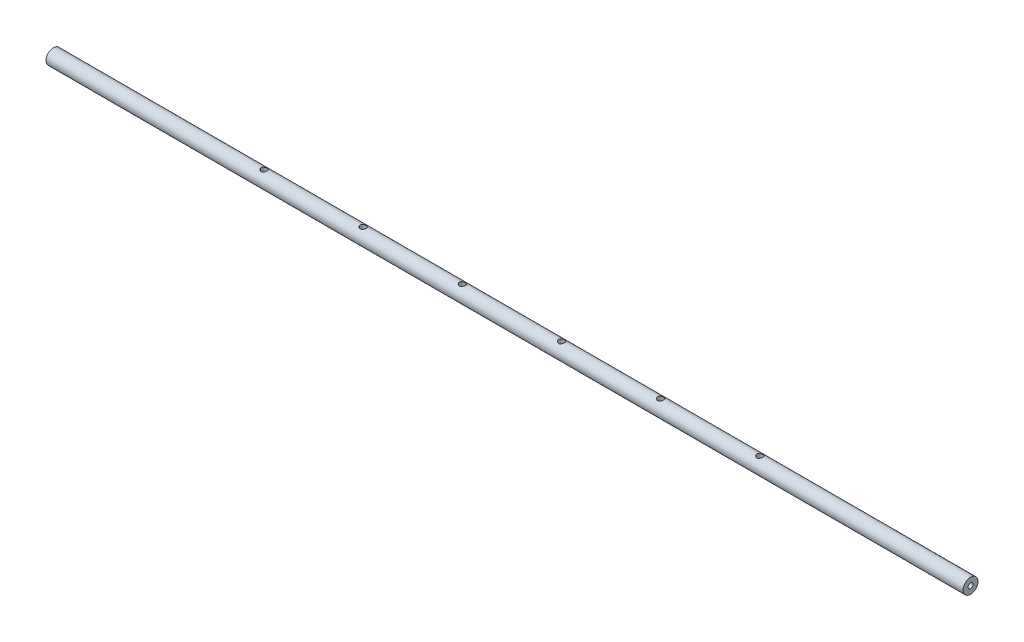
ISO-10303-21;
HEADER;
FILE_DESCRIPTION(('STEP AP214'),'2;1');
FILE_NAME('part.step','',(''),(''),'','','');
FILE_SCHEMA(('AUTOMOTIVE_DESIGN { 1 0 10303 214 1 1 1 1 }'));
ENDSEC;
DATA;
#1=APPLICATION_CONTEXT('core data for automotive mechanical design processes');
#2=APPLICATION_PROTOCOL_DEFINITION('international standard','automotive_design',2000,#1);
#3=PRODUCT_CONTEXT('',#1,'mechanical');
#4=PRODUCT('Part','Part','',(#3));
#5=PRODUCT_RELATED_PRODUCT_CATEGORY('part','',(#4));
#6=PRODUCT_DEFINITION_FORMATION('','',#4);
#7=PRODUCT_DEFINITION_CONTEXT('part definition',#1,'design');
#8=PRODUCT_DEFINITION('design','',#6,#7);
#9=PRODUCT_DEFINITION_SHAPE('','',#8);
#10=(LENGTH_UNIT() NAMED_UNIT(*) SI_UNIT(.MILLI.,.METRE.));
#11=(NAMED_UNIT(*) PLANE_ANGLE_UNIT() SI_UNIT($,.RADIAN.));
#12=(NAMED_UNIT(*) SI_UNIT($,.STERADIAN.) SOLID_ANGLE_UNIT());
#13=UNCERTAINTY_MEASURE_WITH_UNIT(LENGTH_MEASURE(1.E-05),#10,'distance_accuracy_value','');
#14=(GEOMETRIC_REPRESENTATION_CONTEXT(3) GLOBAL_UNCERTAINTY_ASSIGNED_CONTEXT((#13)) GLOBAL_UNIT_ASSIGNED_CONTEXT((#10,
#11,#12)) REPRESENTATION_CONTEXT('',''));
#15=CARTESIAN_POINT('',(0.,0.,0.));
#16=DIRECTION('',(0.,0.,1.));
#17=DIRECTION('',(1.,0.,0.));
#18=AXIS2_PLACEMENT_3D('',#15,#16,#17);
#19=CARTESIAN_POINT('',(462.5,0.,0.));
#20=DIRECTION('',(-1.,0.,0.));
#21=DIRECTION('',(0.,0.,1.));
#22=AXIS2_PLACEMENT_3D('',#19,#20,#21);
#23=CYLINDRICAL_SURFACE('',#22,7.5);
#24=CARTESIAN_POINT('',(250.,-6.87386354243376,2.99999999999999));
#25=CARTESIAN_POINT('',(250.160685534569,-6.87387034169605,2.99999310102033));
#26=CARTESIAN_POINT('',(250.321639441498,-6.87957650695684,2.98701260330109));
#27=CARTESIAN_POINT('',(250.638908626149,-6.901666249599,2.93560066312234));
#28=CARTESIAN_POINT('',(250.795210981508,-6.9180771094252,2.8971041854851));
#29=CARTESIAN_POINT('',(251.098077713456,-6.95940616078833,2.79635331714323));
#30=CARTESIAN_POINT('',(251.244676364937,-6.98429226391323,2.73418843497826));
#31=CARTESIAN_POINT('',(251.525328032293,-7.0397201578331,2.58813019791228));
#32=CARTESIAN_POINT('',(251.659383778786,-7.07026071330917,2.50424158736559));
#33=CARTESIAN_POINT('',(251.918890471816,-7.13551292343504,2.31198302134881));
#34=CARTESIAN_POINT('',(252.043534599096,-7.17035875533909,2.20256905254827));
#35=CARTESIAN_POINT('',(252.273293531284,-7.23918686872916,1.96456364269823));
#36=CARTESIAN_POINT('',(252.378401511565,-7.27316884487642,1.83596552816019));
#37=CARTESIAN_POINT('',(252.570109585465,-7.33805111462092,1.55700947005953));
#38=CARTESIAN_POINT('',(252.655816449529,-7.36877705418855,1.40599344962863));
#39=CARTESIAN_POINT('',(252.800265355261,-7.42205891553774,1.09023798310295));
#40=CARTESIAN_POINT('',(252.859018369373,-7.44461816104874,0.92550415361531));
#41=CARTESIAN_POINT('',(252.94501222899,-7.47807487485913,0.595449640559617));
#42=CARTESIAN_POINT('',(252.973640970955,-7.48948405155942,0.430543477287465));
#43=CARTESIAN_POINT('',(253.003042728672,-7.50120466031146,0.0978994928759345));
#44=CARTESIAN_POINT('',(253.003826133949,-7.50152023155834,-0.0698372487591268));
#45=CARTESIAN_POINT('',(252.978275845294,-7.49132944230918,-0.393348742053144));
#46=CARTESIAN_POINT('',(252.953462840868,-7.48142995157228,-0.549266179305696));
#47=CARTESIAN_POINT('',(252.880010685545,-7.45273937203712,-0.854509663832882));
#48=CARTESIAN_POINT('',(252.831369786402,-7.43394763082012,-1.00383522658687));
#49=CARTESIAN_POINT('',(252.711045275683,-7.388952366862,-1.29434690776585));
#50=CARTESIAN_POINT('',(252.639025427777,-7.36264140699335,-1.43537643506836));
#51=CARTESIAN_POINT('',(252.474302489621,-7.30521877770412,-1.70371222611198));
#52=CARTESIAN_POINT('',(252.38159231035,-7.27410546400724,-1.83101376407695));
#53=CARTESIAN_POINT('',(252.171026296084,-7.20782455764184,-2.07715324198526));
#54=CARTESIAN_POINT('',(252.051919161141,-7.17252489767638,-2.19488676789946));
#55=CARTESIAN_POINT('',(251.795514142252,-7.10342491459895,-2.40916112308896));
#56=CARTESIAN_POINT('',(251.658210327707,-7.06962508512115,-2.50569501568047));
#57=CARTESIAN_POINT('',(251.364371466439,-7.00645346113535,-2.6773562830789));
#58=CARTESIAN_POINT('',(251.207402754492,-6.97723371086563,-2.75180197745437));
#59=CARTESIAN_POINT('',(250.881676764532,-6.92831385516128,-2.87276438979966));
#60=CARTESIAN_POINT('',(250.71292722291,-6.90860756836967,-2.91929924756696));
#61=CARTESIAN_POINT('',(250.379446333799,-6.88244639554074,-2.98043242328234));
#62=CARTESIAN_POINT('',(250.215099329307,-6.87525549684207,-2.99680814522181));
#63=CARTESIAN_POINT('',(249.885884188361,-6.87284246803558,-3.00234198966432));
#64=CARTESIAN_POINT('',(249.721016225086,-6.87761670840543,-2.99150836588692));
#65=CARTESIAN_POINT('',(249.405311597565,-6.89784066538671,-2.94454934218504));
#66=CARTESIAN_POINT('',(249.2542105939,-6.91266686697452,-2.90989959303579));
#67=CARTESIAN_POINT('',(248.960067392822,-6.9505507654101,-2.8182062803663));
#68=CARTESIAN_POINT('',(248.817026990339,-6.97361028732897,-2.76115775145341));
#69=CARTESIAN_POINT('',(248.536596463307,-7.02650672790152,-2.62370345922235));
#70=CARTESIAN_POINT('',(248.399670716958,-7.05658056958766,-2.54244430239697));
#71=CARTESIAN_POINT('',(248.140775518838,-7.11975577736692,-2.35974783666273));
#72=CARTESIAN_POINT('',(248.018812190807,-7.15285837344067,-2.25830231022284));
#73=CARTESIAN_POINT('',(247.783939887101,-7.22131373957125,-2.02926631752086));
#74=CARTESIAN_POINT('',(247.672365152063,-7.2566521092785,-1.90029814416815));
#75=CARTESIAN_POINT('',(247.472234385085,-7.32329691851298,-1.62462545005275));
#76=CARTESIAN_POINT('',(247.383679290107,-7.35460319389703,-1.4779202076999));
#77=CARTESIAN_POINT('',(247.232428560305,-7.40975573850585,-1.17041990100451));
#78=CARTESIAN_POINT('',(247.169726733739,-7.4336037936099,-1.00962822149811));
#79=CARTESIAN_POINT('',(247.0726767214,-7.47109070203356,-0.678590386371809));
#80=CARTESIAN_POINT('',(247.038313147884,-7.48473509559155,-0.508349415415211));
#81=CARTESIAN_POINT('',(247.000742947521,-7.49968512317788,-0.175224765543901));
#82=CARTESIAN_POINT('',(246.995649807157,-7.50173770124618,-0.012585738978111));
#83=CARTESIAN_POINT('',(247.011783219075,-7.49529063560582,0.311150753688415));
#84=CARTESIAN_POINT('',(247.033005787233,-7.48679258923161,0.472248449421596));
#85=CARTESIAN_POINT('',(247.099820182,-7.46057270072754,0.783256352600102));
#86=CARTESIAN_POINT('',(247.144643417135,-7.44314221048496,0.9333582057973));
#87=CARTESIAN_POINT('',(247.256579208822,-7.40092421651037,1.2238835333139));
#88=CARTESIAN_POINT('',(247.323695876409,-7.37613535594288,1.36430521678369));
#89=CARTESIAN_POINT('',(247.48165479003,-7.320271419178,1.63830455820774));
#90=CARTESIAN_POINT('',(247.573414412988,-7.288966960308,1.77130556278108));
#91=CARTESIAN_POINT('',(247.776682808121,-7.22384103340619,2.02058106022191));
#92=CARTESIAN_POINT('',(247.888199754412,-7.19001852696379,2.13684859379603));
#93=CARTESIAN_POINT('',(248.135972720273,-7.1210665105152,2.35680182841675));
#94=CARTESIAN_POINT('',(248.273332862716,-7.08598570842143,2.45926306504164));
#95=CARTESIAN_POINT('',(248.564413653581,-7.02074485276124,2.63977144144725));
#96=CARTESIAN_POINT('',(248.71813622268,-6.99058537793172,2.71781571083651));
#97=CARTESIAN_POINT('',(249.023554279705,-6.94138371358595,2.84098572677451));
#98=CARTESIAN_POINT('',(249.174192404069,-6.92158645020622,2.88843803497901));
#99=CARTESIAN_POINT('',(249.481733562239,-6.89168739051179,2.95907986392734));
#100=CARTESIAN_POINT('',(249.638617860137,-6.88155858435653,2.98233699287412));
#101=CARTESIAN_POINT('',(249.830167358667,-6.87587645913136,2.99538303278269));
#102=CARTESIAN_POINT('',(249.864102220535,-6.87512296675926,2.99711296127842));
#103=CARTESIAN_POINT('',(249.932020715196,-6.87411577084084,2.99942221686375));
#104=CARTESIAN_POINT('',(249.966004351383,-6.8738621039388,3.00000145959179));
#105=CARTESIAN_POINT('',(250.,-6.87386354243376,2.99999999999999));
#106=B_SPLINE_CURVE_WITH_KNOTS('',3,(#24,#25,#26,#27,#28,#29,#30,#31,#32,#33,#34,#35,#36,#37,
#38,#39,#40,#41,#42,#43,#44,#45,#46,#47,#48,#49,#50,#51,#52,#53,#54,#55,#56,#57,#58,#59,#60,#61,
#62,#63,#64,#65,#66,#67,#68,#69,#70,#71,#72,#73,#74,#75,#76,#77,#78,#79,#80,#81,#82,#83,#84,#85,
#86,#87,#88,#89,#90,#91,#92,#93,#94,#95,#96,#97,#98,#99,#100,#101,#102,#103,#104,#105),
.UNSPECIFIED.,.T.,.F.,(4,2,2,2,2,2,2,2,2,2,2,2,2,2,2,2,2,2,2,2,2,2,2,2,2,2,2,2,2,2,2,2,2,2,2,2,
2,2,2,2,4),(0.,0.481916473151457,0.965066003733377,1.44640623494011,1.92764143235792,
2.43383427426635,2.94020361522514,3.46654003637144,3.9926620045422,4.49331274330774,
4.99377667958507,5.46612967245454,5.93851732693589,6.41802450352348,6.89769622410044,
7.4088606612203,7.92019210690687,8.44596688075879,8.97139957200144,9.46473221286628,
9.95791522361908,10.4230087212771,10.8882053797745,11.3722673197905,11.8565267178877,
12.3765560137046,12.8966064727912,13.4165323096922,13.936175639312,14.4219155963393,
14.907582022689,15.3783299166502,15.8491646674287,16.3408057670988,16.8326507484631,
17.3549437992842,17.8772982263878,18.3527499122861,18.8268694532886,18.9288192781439,
19.0307765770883),.UNSPECIFIED.);
#107=CARTESIAN_POINT('',(250.,-6.87386354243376,2.99999999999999));
#108=VERTEX_POINT('',#107);
#109=EDGE_CURVE('E48',#108,#108,#106,.T.);
#110=ORIENTED_EDGE('',*,*,#109,.T.);
#111=EDGE_LOOP('',(#110));
#112=FACE_BOUND('',#111,.T.);
#113=CARTESIAN_POINT('',(250.,6.87386354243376,2.99999999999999));
#114=CARTESIAN_POINT('',(249.839314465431,6.87387034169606,2.99999310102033));
#115=CARTESIAN_POINT('',(249.678360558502,6.87957650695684,2.98701260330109));
#116=CARTESIAN_POINT('',(249.361091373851,6.901666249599,2.93560066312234));
#117=CARTESIAN_POINT('',(249.204789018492,6.9180771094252,2.8971041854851));
#118=CARTESIAN_POINT('',(248.901922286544,6.95940616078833,2.79635331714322));
#119=CARTESIAN_POINT('',(248.755323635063,6.98429226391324,2.73418843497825));
#120=CARTESIAN_POINT('',(248.474671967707,7.0397201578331,2.58813019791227));
#121=CARTESIAN_POINT('',(248.340616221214,7.07026071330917,2.50424158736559));
#122=CARTESIAN_POINT('',(248.081109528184,7.13551292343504,2.3119830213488));
#123=CARTESIAN_POINT('',(247.956465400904,7.17035875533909,2.20256905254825));
#124=CARTESIAN_POINT('',(247.726706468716,7.23918686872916,1.96456364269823));
#125=CARTESIAN_POINT('',(247.621598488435,7.27316884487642,1.83596552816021));
#126=CARTESIAN_POINT('',(247.429890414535,7.33805111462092,1.55700947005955));
#127=CARTESIAN_POINT('',(247.344183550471,7.36877705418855,1.40599344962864));
#128=CARTESIAN_POINT('',(247.199734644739,7.42205891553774,1.09023798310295));
#129=CARTESIAN_POINT('',(247.140981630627,7.44461816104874,0.925504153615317));
#130=CARTESIAN_POINT('',(247.05498777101,7.47807487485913,0.595449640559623));
#131=CARTESIAN_POINT('',(247.026359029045,7.48948405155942,0.430543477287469));
#132=CARTESIAN_POINT('',(246.996957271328,7.50120466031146,0.0978994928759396));
#133=CARTESIAN_POINT('',(246.996173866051,7.50152023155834,-0.0698372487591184));
#134=CARTESIAN_POINT('',(247.021724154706,7.49132944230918,-0.393348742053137));
#135=CARTESIAN_POINT('',(247.046537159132,7.48142995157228,-0.549266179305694));
#136=CARTESIAN_POINT('',(247.119989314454,7.45273937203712,-0.854509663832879));
#137=CARTESIAN_POINT('',(247.168630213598,7.43394763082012,-1.00383522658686));
#138=CARTESIAN_POINT('',(247.288954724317,7.388952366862,-1.29434690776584));
#139=CARTESIAN_POINT('',(247.360974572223,7.36264140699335,-1.43537643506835));
#140=CARTESIAN_POINT('',(247.525697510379,7.30521877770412,-1.70371222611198));
#141=CARTESIAN_POINT('',(247.61840768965,7.27410546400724,-1.83101376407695));
#142=CARTESIAN_POINT('',(247.828973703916,7.20782455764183,-2.07715324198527));
#143=CARTESIAN_POINT('',(247.948080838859,7.17252489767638,-2.19488676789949));
#144=CARTESIAN_POINT('',(248.204485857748,7.10342491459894,-2.40916112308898));
#145=CARTESIAN_POINT('',(248.341789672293,7.06962508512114,-2.50569501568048));
#146=CARTESIAN_POINT('',(248.635628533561,7.00645346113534,-2.67735628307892));
#147=CARTESIAN_POINT('',(248.792597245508,6.97723371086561,-2.75180197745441));
#148=CARTESIAN_POINT('',(249.118323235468,6.92831385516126,-2.8727643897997));
#149=CARTESIAN_POINT('',(249.28707277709,6.90860756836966,-2.91929924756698));
#150=CARTESIAN_POINT('',(249.620553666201,6.88244639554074,-2.98043242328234));
#151=CARTESIAN_POINT('',(249.784900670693,6.87525549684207,-2.99680814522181));
#152=CARTESIAN_POINT('',(250.114115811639,6.87284246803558,-3.00234198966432));
#153=CARTESIAN_POINT('',(250.278983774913,6.87761670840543,-2.99150836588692));
#154=CARTESIAN_POINT('',(250.594688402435,6.8978406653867,-2.94454934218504));
#155=CARTESIAN_POINT('',(250.7457894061,6.91266686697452,-2.90989959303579));
#156=CARTESIAN_POINT('',(251.039932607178,6.95055076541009,-2.81820628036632));
#157=CARTESIAN_POINT('',(251.182973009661,6.97361028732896,-2.76115775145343));
#158=CARTESIAN_POINT('',(251.463403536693,7.02650672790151,-2.62370345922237));
#159=CARTESIAN_POINT('',(251.600329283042,7.05658056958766,-2.54244430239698));
#160=CARTESIAN_POINT('',(251.859224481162,7.11975577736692,-2.35974783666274));
#161=CARTESIAN_POINT('',(251.981187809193,7.15285837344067,-2.25830231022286));
#162=CARTESIAN_POINT('',(252.216060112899,7.22131373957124,-2.02926631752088));
#163=CARTESIAN_POINT('',(252.327634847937,7.2566521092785,-1.90029814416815));
#164=CARTESIAN_POINT('',(252.527765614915,7.32329691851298,-1.62462545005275));
#165=CARTESIAN_POINT('',(252.616320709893,7.35460319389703,-1.47792020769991));
#166=CARTESIAN_POINT('',(252.767571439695,7.40975573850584,-1.17041990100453));
#167=CARTESIAN_POINT('',(252.830273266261,7.4336037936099,-1.00962822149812));
#168=CARTESIAN_POINT('',(252.9273232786,7.47109070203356,-0.678590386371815));
#169=CARTESIAN_POINT('',(252.961686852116,7.48473509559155,-0.508349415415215));
#170=CARTESIAN_POINT('',(252.999257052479,7.49968512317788,-0.175224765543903));
#171=CARTESIAN_POINT('',(253.004350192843,7.50173770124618,-0.0125857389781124));
#172=CARTESIAN_POINT('',(252.988216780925,7.49529063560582,0.311150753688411));
#173=CARTESIAN_POINT('',(252.966994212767,7.48679258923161,0.47224844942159));
#174=CARTESIAN_POINT('',(252.900179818,7.46057270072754,0.783256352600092));
#175=CARTESIAN_POINT('',(252.855356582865,7.44314221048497,0.933358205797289));
#176=CARTESIAN_POINT('',(252.743420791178,7.40092421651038,1.22388353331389));
#177=CARTESIAN_POINT('',(252.676304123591,7.37613535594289,1.36430521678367));
#178=CARTESIAN_POINT('',(252.51834520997,7.320271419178,1.63830455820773));
#179=CARTESIAN_POINT('',(252.426585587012,7.288966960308,1.77130556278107));
#180=CARTESIAN_POINT('',(252.22331719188,7.2238410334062,2.0205810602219));
#181=CARTESIAN_POINT('',(252.111800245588,7.19001852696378,2.13684859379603));
#182=CARTESIAN_POINT('',(251.864027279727,7.1210665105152,2.35680182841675));
#183=CARTESIAN_POINT('',(251.726667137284,7.08598570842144,2.45926306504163));
#184=CARTESIAN_POINT('',(251.435586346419,7.02074485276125,2.63977144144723));
#185=CARTESIAN_POINT('',(251.28186377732,6.99058537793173,2.71781571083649));
#186=CARTESIAN_POINT('',(250.976445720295,6.94138371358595,2.8409857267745));
#187=CARTESIAN_POINT('',(250.825807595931,6.92158645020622,2.888438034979));
#188=CARTESIAN_POINT('',(250.518266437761,6.8916873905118,2.95907986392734));
#189=CARTESIAN_POINT('',(250.361382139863,6.88155858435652,2.98233699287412));
#190=CARTESIAN_POINT('',(250.169832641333,6.87587645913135,2.99538303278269));
#191=CARTESIAN_POINT('',(250.135897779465,6.87512296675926,2.99711296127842));
#192=CARTESIAN_POINT('',(250.067979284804,6.87411577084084,2.99942221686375));
#193=CARTESIAN_POINT('',(250.033995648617,6.8738621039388,3.00000145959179));
#194=CARTESIAN_POINT('',(250.,6.87386354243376,2.99999999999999));
#195=B_SPLINE_CURVE_WITH_KNOTS('',3,(#113,#114,#115,#116,#117,#118,#119,#120,#121,#122,#123,
#124,#125,#126,#127,#128,#129,#130,#131,#132,#133,#134,#135,#136,#137,#138,#139,#140,#141,#142,
#143,#144,#145,#146,#147,#148,#149,#150,#151,#152,#153,#154,#155,#156,#157,#158,#159,#160,#161,
#162,#163,#164,#165,#166,#167,#168,#169,#170,#171,#172,#173,#174,#175,#176,#177,#178,#179,#180,
#181,#182,#183,#184,#185,#186,#187,#188,#189,#190,#191,#192,#193,#194),.UNSPECIFIED.,.T.,.F.,(4,
2,2,2,2,2,2,2,2,2,2,2,2,2,2,2,2,2,2,2,2,2,2,2,2,2,2,2,2,2,2,2,2,2,2,2,2,2,2,2,4),(0.,
0.481916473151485,0.965066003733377,1.44640623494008,1.92764143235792,2.43383427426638,
2.94020361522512,3.46654003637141,3.99266200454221,4.49331274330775,4.99377667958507,
5.46612967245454,5.93851732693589,6.41802450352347,6.89769622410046,7.40886066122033,
7.92019210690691,8.44596688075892,8.97139957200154,9.46473221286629,9.95791522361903,
10.4230087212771,10.8882053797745,11.3722673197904,11.8565267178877,12.3765560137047,
12.8966064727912,13.4165323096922,13.936175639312,14.4219155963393,14.907582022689,
15.3783299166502,15.8491646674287,16.3408057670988,16.832650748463,17.3549437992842,
17.8772982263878,18.3527499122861,18.8268694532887,18.9288192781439,19.0307765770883),.UNSPECIFIED.);
#196=CARTESIAN_POINT('',(250.,6.87386354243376,2.99999999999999));
#197=VERTEX_POINT('',#196);
#198=EDGE_CURVE('E151',#197,#197,#195,.T.);
#199=ORIENTED_EDGE('',*,*,#198,.T.);
#200=EDGE_LOOP('',(#199));
#201=FACE_BOUND('',#200,.T.);
#202=CARTESIAN_POINT('',(150.,-6.87386354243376,2.99999999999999));
#203=CARTESIAN_POINT('',(150.160685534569,-6.87387034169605,2.99999310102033));
#204=CARTESIAN_POINT('',(150.321639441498,-6.87957650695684,2.98701260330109));
#205=CARTESIAN_POINT('',(150.638908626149,-6.901666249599,2.93560066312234));
#206=CARTESIAN_POINT('',(150.795210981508,-6.9180771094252,2.8971041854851));
#207=CARTESIAN_POINT('',(151.098077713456,-6.95940616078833,2.79635331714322));
#208=CARTESIAN_POINT('',(151.244676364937,-6.98429226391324,2.73418843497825));
#209=CARTESIAN_POINT('',(151.525328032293,-7.0397201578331,2.58813019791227));
#210=CARTESIAN_POINT('',(151.659383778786,-7.07026071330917,2.50424158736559));
#211=CARTESIAN_POINT('',(151.918890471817,-7.13551292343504,2.3119830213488));
#212=CARTESIAN_POINT('',(152.043534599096,-7.17035875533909,2.20256905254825));
#213=CARTESIAN_POINT('',(152.273293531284,-7.23918686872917,1.96456364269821));
#214=CARTESIAN_POINT('',(152.378401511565,-7.27316884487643,1.83596552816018));
#215=CARTESIAN_POINT('',(152.570109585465,-7.33805111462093,1.55700947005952));
#216=CARTESIAN_POINT('',(152.655816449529,-7.36877705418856,1.40599344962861));
#217=CARTESIAN_POINT('',(152.800265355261,-7.42205891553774,1.09023798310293));
#218=CARTESIAN_POINT('',(152.859018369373,-7.44461816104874,0.9255041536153));
#219=CARTESIAN_POINT('',(152.94501222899,-7.47807487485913,0.595449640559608));
#220=CARTESIAN_POINT('',(152.973640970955,-7.48948405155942,0.430543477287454));
#221=CARTESIAN_POINT('',(153.003042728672,-7.50120466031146,0.0978994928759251));
#222=CARTESIAN_POINT('',(153.003826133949,-7.50152023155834,-0.0698372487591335));
#223=CARTESIAN_POINT('',(152.978275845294,-7.49132944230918,-0.393348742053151));
#224=CARTESIAN_POINT('',(152.953462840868,-7.48142995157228,-0.549266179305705));
#225=CARTESIAN_POINT('',(152.880010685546,-7.45273937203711,-0.854509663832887));
#226=CARTESIAN_POINT('',(152.831369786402,-7.43394763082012,-1.00383522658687));
#227=CARTESIAN_POINT('',(152.711045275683,-7.388952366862,-1.29434690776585));
#228=CARTESIAN_POINT('',(152.639025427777,-7.36264140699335,-1.43537643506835));
#229=CARTESIAN_POINT('',(152.474302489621,-7.30521877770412,-1.70371222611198));
#230=CARTESIAN_POINT('',(152.38159231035,-7.27410546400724,-1.83101376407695));
#231=CARTESIAN_POINT('',(152.171026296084,-7.20782455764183,-2.07715324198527));
#232=CARTESIAN_POINT('',(152.051919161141,-7.17252489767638,-2.19488676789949));
#233=CARTESIAN_POINT('',(151.795514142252,-7.10342491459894,-2.40916112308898));
#234=CARTESIAN_POINT('',(151.658210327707,-7.06962508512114,-2.50569501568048));
#235=CARTESIAN_POINT('',(151.364371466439,-7.00645346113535,-2.67735628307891));
#236=CARTESIAN_POINT('',(151.207402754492,-6.97723371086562,-2.75180197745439));
#237=CARTESIAN_POINT('',(150.881676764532,-6.92831385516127,-2.87276438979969));
#238=CARTESIAN_POINT('',(150.71292722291,-6.90860756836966,-2.91929924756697));
#239=CARTESIAN_POINT('',(150.379446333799,-6.88244639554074,-2.98043242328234));
#240=CARTESIAN_POINT('',(150.215099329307,-6.87525549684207,-2.99680814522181));
#241=CARTESIAN_POINT('',(149.885884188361,-6.87284246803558,-3.00234198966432));
#242=CARTESIAN_POINT('',(149.721016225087,-6.87761670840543,-2.99150836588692));
#243=CARTESIAN_POINT('',(149.405311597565,-6.8978406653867,-2.94454934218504));
#244=CARTESIAN_POINT('',(149.2542105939,-6.91266686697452,-2.90989959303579));
#245=CARTESIAN_POINT('',(148.960067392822,-6.9505507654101,-2.8182062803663));
#246=CARTESIAN_POINT('',(148.817026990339,-6.97361028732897,-2.76115775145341));
#247=CARTESIAN_POINT('',(148.536596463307,-7.02650672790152,-2.62370345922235));
#248=CARTESIAN_POINT('',(148.399670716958,-7.05658056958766,-2.54244430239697));
#249=CARTESIAN_POINT('',(148.140775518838,-7.11975577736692,-2.35974783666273));
#250=CARTESIAN_POINT('',(148.018812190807,-7.15285837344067,-2.25830231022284));
#251=CARTESIAN_POINT('',(147.783939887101,-7.22131373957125,-2.02926631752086));
#252=CARTESIAN_POINT('',(147.672365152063,-7.2566521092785,-1.90029814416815));
#253=CARTESIAN_POINT('',(147.472234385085,-7.32329691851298,-1.62462545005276));
#254=CARTESIAN_POINT('',(147.383679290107,-7.35460319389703,-1.47792020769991));
#255=CARTESIAN_POINT('',(147.232428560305,-7.40975573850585,-1.17041990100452));
#256=CARTESIAN_POINT('',(147.16972673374,-7.4336037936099,-1.00962822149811));
#257=CARTESIAN_POINT('',(147.0726767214,-7.47109070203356,-0.678590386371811));
#258=CARTESIAN_POINT('',(147.038313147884,-7.48473509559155,-0.508349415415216));
#259=CARTESIAN_POINT('',(147.000742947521,-7.49968512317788,-0.175224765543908));
#260=CARTESIAN_POINT('',(146.995649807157,-7.50173770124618,-0.0125857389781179));
#261=CARTESIAN_POINT('',(147.011783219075,-7.49529063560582,0.311150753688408));
#262=CARTESIAN_POINT('',(147.033005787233,-7.48679258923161,0.472248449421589));
#263=CARTESIAN_POINT('',(147.099820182,-7.46057270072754,0.783256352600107));
#264=CARTESIAN_POINT('',(147.144643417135,-7.44314221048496,0.933358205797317));
#265=CARTESIAN_POINT('',(147.256579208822,-7.40092421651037,1.22388353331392));
#266=CARTESIAN_POINT('',(147.323695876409,-7.37613535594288,1.36430521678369));
#267=CARTESIAN_POINT('',(147.48165479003,-7.320271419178,1.63830455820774));
#268=CARTESIAN_POINT('',(147.573414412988,-7.288966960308,1.77130556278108));
#269=CARTESIAN_POINT('',(147.776682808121,-7.2238410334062,2.02058106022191));
#270=CARTESIAN_POINT('',(147.888199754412,-7.19001852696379,2.13684859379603));
#271=CARTESIAN_POINT('',(148.135972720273,-7.1210665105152,2.35680182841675));
#272=CARTESIAN_POINT('',(148.273332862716,-7.08598570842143,2.45926306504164));
#273=CARTESIAN_POINT('',(148.564413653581,-7.02074485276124,2.63977144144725));
#274=CARTESIAN_POINT('',(148.71813622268,-6.99058537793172,2.71781571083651));
#275=CARTESIAN_POINT('',(149.023554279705,-6.94138371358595,2.8409857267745));
#276=CARTESIAN_POINT('',(149.174192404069,-6.92158645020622,2.888438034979));
#277=CARTESIAN_POINT('',(149.481733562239,-6.8916873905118,2.95907986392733));
#278=CARTESIAN_POINT('',(149.638617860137,-6.88155858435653,2.98233699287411));
#279=CARTESIAN_POINT('',(149.830167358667,-6.87587645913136,2.99538303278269));
#280=CARTESIAN_POINT('',(149.864102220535,-6.87512296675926,2.99711296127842));
#281=CARTESIAN_POINT('',(149.932020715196,-6.87411577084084,2.99942221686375));
#282=CARTESIAN_POINT('',(149.966004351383,-6.8738621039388,3.00000145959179));
#283=CARTESIAN_POINT('',(150.,-6.87386354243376,2.99999999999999));
#284=B_SPLINE_CURVE_WITH_KNOTS('',3,(#202,#203,#204,#205,#206,#207,#208,#209,#210,#211,#212,
#213,#214,#215,#216,#217,#218,#219,#220,#221,#222,#223,#224,#225,#226,#227,#228,#229,#230,#231,
#232,#233,#234,#235,#236,#237,#238,#239,#240,#241,#242,#243,#244,#245,#246,#247,#248,#249,#250,
#251,#252,#253,#254,#255,#256,#257,#258,#259,#260,#261,#262,#263,#264,#265,#266,#267,#268,#269,
#270,#271,#272,#273,#274,#275,#276,#277,#278,#279,#280,#281,#282,#283),.UNSPECIFIED.,.T.,.F.,(4,
2,2,2,2,2,2,2,2,2,2,2,2,2,2,2,2,2,2,2,2,2,2,2,2,2,2,2,2,2,2,2,2,2,2,2,2,2,2,2,4),(0.,
0.481916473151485,0.965066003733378,1.44640623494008,1.92764143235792,2.43383427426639,
2.94020361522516,3.46654003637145,3.99266200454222,4.49331274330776,4.99377667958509,
5.46612967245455,5.9385173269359,6.41802450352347,6.89769622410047,7.40886066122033,
7.92019210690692,8.44596688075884,8.97139957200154,9.46473221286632,9.95791522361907,
10.4230087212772,10.8882053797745,11.3722673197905,11.8565267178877,12.3765560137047,
12.8966064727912,13.4165323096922,13.936175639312,14.4219155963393,14.907582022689,
15.3783299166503,15.8491646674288,16.3408057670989,16.8326507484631,17.3549437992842,
17.8772982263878,18.3527499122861,18.8268694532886,18.9288192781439,19.0307765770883),.UNSPECIFIED.);
#285=CARTESIAN_POINT('',(150.,-6.87386354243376,2.99999999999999));
#286=VERTEX_POINT('',#285);
#287=EDGE_CURVE('E155',#286,#286,#284,.T.);
#288=ORIENTED_EDGE('',*,*,#287,.T.);
#289=EDGE_LOOP('',(#288));
#290=FACE_BOUND('',#289,.T.);
#291=CARTESIAN_POINT('',(150.,6.87386354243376,2.99999999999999));
#292=CARTESIAN_POINT('',(149.839314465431,6.87387034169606,2.99999310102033));
#293=CARTESIAN_POINT('',(149.678360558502,6.87957650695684,2.98701260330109));
#294=CARTESIAN_POINT('',(149.361091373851,6.901666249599,2.93560066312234));
#295=CARTESIAN_POINT('',(149.204789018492,6.9180771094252,2.89710418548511));
#296=CARTESIAN_POINT('',(148.901922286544,6.95940616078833,2.79635331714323));
#297=CARTESIAN_POINT('',(148.755323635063,6.98429226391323,2.73418843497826));
#298=CARTESIAN_POINT('',(148.474671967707,7.0397201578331,2.58813019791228));
#299=CARTESIAN_POINT('',(148.340616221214,7.07026071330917,2.50424158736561));
#300=CARTESIAN_POINT('',(148.081109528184,7.13551292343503,2.31198302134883));
#301=CARTESIAN_POINT('',(147.956465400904,7.17035875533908,2.20256905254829));
#302=CARTESIAN_POINT('',(147.726706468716,7.23918686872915,1.96456364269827));
#303=CARTESIAN_POINT('',(147.621598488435,7.27316884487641,1.83596552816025));
#304=CARTESIAN_POINT('',(147.429890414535,7.33805111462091,1.55700947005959));
#305=CARTESIAN_POINT('',(147.344183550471,7.36877705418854,1.40599344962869));
#306=CARTESIAN_POINT('',(147.199734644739,7.42205891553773,1.090237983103));
#307=CARTESIAN_POINT('',(147.140981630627,7.44461816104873,0.925504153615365));
#308=CARTESIAN_POINT('',(147.05498777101,7.47807487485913,0.595449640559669));
#309=CARTESIAN_POINT('',(147.026359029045,7.48948405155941,0.430543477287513));
#310=CARTESIAN_POINT('',(146.996957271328,7.50120466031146,0.0978994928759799));
#311=CARTESIAN_POINT('',(146.996173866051,7.50152023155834,-0.0698372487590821));
#312=CARTESIAN_POINT('',(147.021724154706,7.49132944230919,-0.393348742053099));
#313=CARTESIAN_POINT('',(147.046537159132,7.48142995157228,-0.54926617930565));
#314=CARTESIAN_POINT('',(147.119989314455,7.45273937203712,-0.854509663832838));
#315=CARTESIAN_POINT('',(147.168630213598,7.43394763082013,-1.00383522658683));
#316=CARTESIAN_POINT('',(147.288954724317,7.38895236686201,-1.29434690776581));
#317=CARTESIAN_POINT('',(147.360974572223,7.36264140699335,-1.43537643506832));
#318=CARTESIAN_POINT('',(147.525697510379,7.30521877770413,-1.70371222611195));
#319=CARTESIAN_POINT('',(147.61840768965,7.27410546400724,-1.83101376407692));
#320=CARTESIAN_POINT('',(147.828973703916,7.20782455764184,-2.07715324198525));
#321=CARTESIAN_POINT('',(147.948080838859,7.17252489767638,-2.19488676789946));
#322=CARTESIAN_POINT('',(148.204485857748,7.10342491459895,-2.40916112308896));
#323=CARTESIAN_POINT('',(148.341789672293,7.06962508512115,-2.50569501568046));
#324=CARTESIAN_POINT('',(148.635628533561,7.00645346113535,-2.6773562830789));
#325=CARTESIAN_POINT('',(148.792597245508,6.97723371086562,-2.75180197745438));
#326=CARTESIAN_POINT('',(149.118323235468,6.92831385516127,-2.87276438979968));
#327=CARTESIAN_POINT('',(149.28707277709,6.90860756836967,-2.91929924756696));
#328=CARTESIAN_POINT('',(149.620553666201,6.88244639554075,-2.98043242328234));
#329=CARTESIAN_POINT('',(149.784900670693,6.87525549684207,-2.99680814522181));
#330=CARTESIAN_POINT('',(150.114115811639,6.87284246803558,-3.00234198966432));
#331=CARTESIAN_POINT('',(150.278983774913,6.87761670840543,-2.99150836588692));
#332=CARTESIAN_POINT('',(150.594688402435,6.8978406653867,-2.94454934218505));
#333=CARTESIAN_POINT('',(150.7457894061,6.91266686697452,-2.90989959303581));
#334=CARTESIAN_POINT('',(151.039932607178,6.95055076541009,-2.81820628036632));
#335=CARTESIAN_POINT('',(151.182973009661,6.97361028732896,-2.76115775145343));
#336=CARTESIAN_POINT('',(151.463403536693,7.02650672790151,-2.62370345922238));
#337=CARTESIAN_POINT('',(151.600329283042,7.05658056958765,-2.542444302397));
#338=CARTESIAN_POINT('',(151.859224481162,7.11975577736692,-2.35974783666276));
#339=CARTESIAN_POINT('',(151.981187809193,7.15285837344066,-2.25830231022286));
#340=CARTESIAN_POINT('',(152.216060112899,7.22131373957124,-2.02926631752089));
#341=CARTESIAN_POINT('',(152.327634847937,7.25665210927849,-1.90029814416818));
#342=CARTESIAN_POINT('',(152.527765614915,7.32329691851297,-1.62462545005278));
#343=CARTESIAN_POINT('',(152.616320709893,7.35460319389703,-1.47792020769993));
#344=CARTESIAN_POINT('',(152.767571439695,7.40975573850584,-1.17041990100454));
#345=CARTESIAN_POINT('',(152.83027326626,7.4336037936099,-1.00962822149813));
#346=CARTESIAN_POINT('',(152.9273232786,7.47109070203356,-0.678590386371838));
#347=CARTESIAN_POINT('',(152.961686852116,7.48473509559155,-0.508349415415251));
#348=CARTESIAN_POINT('',(152.999257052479,7.49968512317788,-0.17522476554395));
#349=CARTESIAN_POINT('',(153.004350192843,7.50173770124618,-0.0125857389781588));
#350=CARTESIAN_POINT('',(152.988216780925,7.49529063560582,0.311150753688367));
#351=CARTESIAN_POINT('',(152.966994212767,7.48679258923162,0.472248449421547));
#352=CARTESIAN_POINT('',(152.900179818,7.46057270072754,0.783256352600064));
#353=CARTESIAN_POINT('',(152.855356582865,7.44314221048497,0.933358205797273));
#354=CARTESIAN_POINT('',(152.743420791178,7.40092421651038,1.22388353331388));
#355=CARTESIAN_POINT('',(152.676304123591,7.37613535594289,1.36430521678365));
#356=CARTESIAN_POINT('',(152.51834520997,7.32027141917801,1.6383045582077));
#357=CARTESIAN_POINT('',(152.426585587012,7.28896696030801,1.77130556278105));
#358=CARTESIAN_POINT('',(152.22331719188,7.2238410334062,2.02058106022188));
#359=CARTESIAN_POINT('',(152.111800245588,7.1900185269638,2.136848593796));
#360=CARTESIAN_POINT('',(151.864027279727,7.12106651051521,2.35680182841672));
#361=CARTESIAN_POINT('',(151.726667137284,7.08598570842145,2.45926306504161));
#362=CARTESIAN_POINT('',(151.435586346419,7.02074485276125,2.63977144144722));
#363=CARTESIAN_POINT('',(151.28186377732,6.99058537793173,2.71781571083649));
#364=CARTESIAN_POINT('',(150.976445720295,6.94138371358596,2.84098572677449));
#365=CARTESIAN_POINT('',(150.825807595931,6.92158645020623,2.88843803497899));
#366=CARTESIAN_POINT('',(150.518266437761,6.8916873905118,2.95907986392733));
#367=CARTESIAN_POINT('',(150.361382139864,6.88155858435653,2.9823369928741));
#368=CARTESIAN_POINT('',(150.169832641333,6.87587645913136,2.99538303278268));
#369=CARTESIAN_POINT('',(150.135897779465,6.87512296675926,2.99711296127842));
#370=CARTESIAN_POINT('',(150.067979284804,6.87411577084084,2.99942221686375));
#371=CARTESIAN_POINT('',(150.033995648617,6.8738621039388,3.00000145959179));
#372=CARTESIAN_POINT('',(150.,6.87386354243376,2.99999999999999));
#373=B_SPLINE_CURVE_WITH_KNOTS('',3,(#291,#292,#293,#294,#295,#296,#297,#298,#299,#300,#301,
#302,#303,#304,#305,#306,#307,#308,#309,#310,#311,#312,#313,#314,#315,#316,#317,#318,#319,#320,
#321,#322,#323,#324,#325,#326,#327,#328,#329,#330,#331,#332,#333,#334,#335,#336,#337,#338,#339,
#340,#341,#342,#343,#344,#345,#346,#347,#348,#349,#350,#351,#352,#353,#354,#355,#356,#357,#358,
#359,#360,#361,#362,#363,#364,#365,#366,#367,#368,#369,#370,#371,#372),.UNSPECIFIED.,.T.,.F.,(4,
2,2,2,2,2,2,2,2,2,2,2,2,2,2,2,2,2,2,2,2,2,2,2,2,2,2,2,2,2,2,2,2,2,2,2,2,2,2,2,4),(0.,
0.481916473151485,0.965066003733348,1.44640623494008,1.92764143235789,2.43383427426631,
2.94020361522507,3.46654003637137,3.99266200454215,4.49331274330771,4.99377667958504,
5.4661296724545,5.93851732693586,6.41802450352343,6.89769622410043,7.4088606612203,
7.92019210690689,8.44596688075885,8.9713995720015,9.46473221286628,9.95791522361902,
10.4230087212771,10.8882053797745,11.3722673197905,11.8565267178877,12.3765560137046,
12.8966064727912,13.4165323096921,13.936175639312,14.4219155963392,14.907582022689,
15.3783299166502,15.8491646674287,16.3408057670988,16.832650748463,17.3549437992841,
17.8772982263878,18.3527499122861,18.8268694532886,18.9288192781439,19.0307765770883),.UNSPECIFIED.);
#374=CARTESIAN_POINT('',(150.,6.87386354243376,2.99999999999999));
#375=VERTEX_POINT('',#374);
#376=EDGE_CURVE('E159',#375,#375,#373,.T.);
#377=ORIENTED_EDGE('',*,*,#376,.T.);
#378=EDGE_LOOP('',(#377));
#379=FACE_BOUND('',#378,.T.);
#380=CARTESIAN_POINT('',(50.,-6.87386354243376,2.99999999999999));
#381=CARTESIAN_POINT('',(50.1606855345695,-6.87387034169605,2.99999310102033));
#382=CARTESIAN_POINT('',(50.3216394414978,-6.87957650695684,2.98701260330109));
#383=CARTESIAN_POINT('',(50.6389086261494,-6.901666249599,2.93560066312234));
#384=CARTESIAN_POINT('',(50.7952109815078,-6.9180771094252,2.8971041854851));
#385=CARTESIAN_POINT('',(51.0980777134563,-6.95940616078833,2.79635331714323));
#386=CARTESIAN_POINT('',(51.2446763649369,-6.98429226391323,2.73418843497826));
#387=CARTESIAN_POINT('',(51.5253280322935,-7.0397201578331,2.58813019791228));
#388=CARTESIAN_POINT('',(51.6593837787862,-7.07026071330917,2.5042415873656));
#389=CARTESIAN_POINT('',(51.9188904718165,-7.13551292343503,2.3119830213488));
#390=CARTESIAN_POINT('',(52.0435345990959,-7.17035875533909,2.20256905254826));
#391=CARTESIAN_POINT('',(52.2732935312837,-7.23918686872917,1.96456364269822));
#392=CARTESIAN_POINT('',(52.3784015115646,-7.27316884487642,1.83596552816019));
#393=CARTESIAN_POINT('',(52.5701095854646,-7.33805111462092,1.55700947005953));
#394=CARTESIAN_POINT('',(52.655816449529,-7.36877705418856,1.40599344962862));
#395=CARTESIAN_POINT('',(52.8002653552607,-7.42205891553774,1.09023798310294));
#396=CARTESIAN_POINT('',(52.8590183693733,-7.44461816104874,0.925504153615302));
#397=CARTESIAN_POINT('',(52.9450122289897,-7.47807487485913,0.595449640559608));
#398=CARTESIAN_POINT('',(52.9736409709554,-7.48948405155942,0.430543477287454));
#399=CARTESIAN_POINT('',(53.0030427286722,-7.50120466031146,0.0978994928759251));
#400=CARTESIAN_POINT('',(53.0038261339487,-7.50152023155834,-0.0698372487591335));
#401=CARTESIAN_POINT('',(52.9782758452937,-7.49132944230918,-0.393348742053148));
#402=CARTESIAN_POINT('',(52.953462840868,-7.48142995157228,-0.549266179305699));
#403=CARTESIAN_POINT('',(52.8800106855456,-7.45273937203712,-0.854509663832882));
#404=CARTESIAN_POINT('',(52.8313697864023,-7.43394763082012,-1.00383522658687));
#405=CARTESIAN_POINT('',(52.7110452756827,-7.388952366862,-1.29434690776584));
#406=CARTESIAN_POINT('',(52.639025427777,-7.36264140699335,-1.43537643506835));
#407=CARTESIAN_POINT('',(52.4743024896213,-7.30521877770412,-1.70371222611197));
#408=CARTESIAN_POINT('',(52.3815923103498,-7.27410546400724,-1.83101376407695));
#409=CARTESIAN_POINT('',(52.1710262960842,-7.20782455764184,-2.07715324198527));
#410=CARTESIAN_POINT('',(52.0519191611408,-7.17252489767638,-2.19488676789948));
#411=CARTESIAN_POINT('',(51.795514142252,-7.10342491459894,-2.40916112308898));
#412=CARTESIAN_POINT('',(51.6582103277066,-7.06962508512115,-2.50569501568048));
#413=CARTESIAN_POINT('',(51.3643714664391,-7.00645346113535,-2.67735628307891));
#414=CARTESIAN_POINT('',(51.2074027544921,-6.97723371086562,-2.75180197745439));
#415=CARTESIAN_POINT('',(50.8816767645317,-6.92831385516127,-2.87276438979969));
#416=CARTESIAN_POINT('',(50.7129272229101,-6.90860756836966,-2.91929924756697));
#417=CARTESIAN_POINT('',(50.3794463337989,-6.88244639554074,-2.98043242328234));
#418=CARTESIAN_POINT('',(50.2150993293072,-6.87525549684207,-2.99680814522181));
#419=CARTESIAN_POINT('',(49.8858841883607,-6.87284246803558,-3.00234198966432));
#420=CARTESIAN_POINT('',(49.7210162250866,-6.87761670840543,-2.99150836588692));
#421=CARTESIAN_POINT('',(49.4053115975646,-6.89784066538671,-2.94454934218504));
#422=CARTESIAN_POINT('',(49.2542105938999,-6.91266686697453,-2.90989959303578));
#423=CARTESIAN_POINT('',(48.9600673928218,-6.9505507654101,-2.81820628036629));
#424=CARTESIAN_POINT('',(48.8170269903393,-6.97361028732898,-2.7611577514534));
#425=CARTESIAN_POINT('',(48.5365964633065,-7.02650672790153,-2.62370345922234));
#426=CARTESIAN_POINT('',(48.3996707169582,-7.05658056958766,-2.54244430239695));
#427=CARTESIAN_POINT('',(48.1407755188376,-7.11975577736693,-2.35974783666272));
#428=CARTESIAN_POINT('',(48.0188121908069,-7.15285837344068,-2.25830231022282));
#429=CARTESIAN_POINT('',(47.783939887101,-7.22131373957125,-2.02926631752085));
#430=CARTESIAN_POINT('',(47.6723651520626,-7.2566521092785,-1.90029814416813));
#431=CARTESIAN_POINT('',(47.4722343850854,-7.32329691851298,-1.62462545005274));
#432=CARTESIAN_POINT('',(47.3836792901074,-7.35460319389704,-1.4779202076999));
#433=CARTESIAN_POINT('',(47.232428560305,-7.40975573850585,-1.17041990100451));
#434=CARTESIAN_POINT('',(47.1697267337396,-7.4336037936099,-1.00962822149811));
#435=CARTESIAN_POINT('',(47.0726767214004,-7.47109070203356,-0.678590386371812));
#436=CARTESIAN_POINT('',(47.038313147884,-7.48473509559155,-0.50834941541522));
#437=CARTESIAN_POINT('',(47.0007429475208,-7.49968512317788,-0.175224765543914));
#438=CARTESIAN_POINT('',(46.995649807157,-7.50173770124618,-0.0125857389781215));
#439=CARTESIAN_POINT('',(47.0117832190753,-7.49529063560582,0.311150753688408));
#440=CARTESIAN_POINT('',(47.0330057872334,-7.48679258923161,0.47224844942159));
#441=CARTESIAN_POINT('',(47.0998201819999,-7.46057270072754,0.783256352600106));
#442=CARTESIAN_POINT('',(47.1446434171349,-7.44314221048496,0.933358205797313));
#443=CARTESIAN_POINT('',(47.2565792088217,-7.40092421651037,1.22388353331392));
#444=CARTESIAN_POINT('',(47.3236958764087,-7.37613535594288,1.36430521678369));
#445=CARTESIAN_POINT('',(47.4816547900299,-7.320271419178,1.63830455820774));
#446=CARTESIAN_POINT('',(47.5734144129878,-7.288966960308,1.77130556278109));
#447=CARTESIAN_POINT('',(47.7766828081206,-7.22384103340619,2.02058106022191));
#448=CARTESIAN_POINT('',(47.8881997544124,-7.19001852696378,2.13684859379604));
#449=CARTESIAN_POINT('',(48.135972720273,-7.1210665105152,2.35680182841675));
#450=CARTESIAN_POINT('',(48.2733328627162,-7.08598570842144,2.45926306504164));
#451=CARTESIAN_POINT('',(48.5644136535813,-7.02074485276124,2.63977144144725));
#452=CARTESIAN_POINT('',(48.7181362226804,-6.99058537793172,2.71781571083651));
#453=CARTESIAN_POINT('',(49.0235542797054,-6.94138371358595,2.84098572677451));
#454=CARTESIAN_POINT('',(49.1741924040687,-6.92158645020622,2.88843803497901));
#455=CARTESIAN_POINT('',(49.481733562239,-6.8916873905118,2.95907986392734));
#456=CARTESIAN_POINT('',(49.6386178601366,-6.88155858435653,2.98233699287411));
#457=CARTESIAN_POINT('',(49.8301673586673,-6.87587645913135,2.99538303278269));
#458=CARTESIAN_POINT('',(49.8641022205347,-6.87512296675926,2.99711296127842));
#459=CARTESIAN_POINT('',(49.9320207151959,-6.87411577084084,2.99942221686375));
#460=CARTESIAN_POINT('',(49.9660043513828,-6.8738621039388,3.00000145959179));
#461=CARTESIAN_POINT('',(50.,-6.87386354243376,2.99999999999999));
#462=B_SPLINE_CURVE_WITH_KNOTS('',3,(#380,#381,#382,#383,#384,#385,#386,#387,#388,#389,#390,
#391,#392,#393,#394,#395,#396,#397,#398,#399,#400,#401,#402,#403,#404,#405,#406,#407,#408,#409,
#410,#411,#412,#413,#414,#415,#416,#417,#418,#419,#420,#421,#422,#423,#424,#425,#426,#427,#428,
#429,#430,#431,#432,#433,#434,#435,#436,#437,#438,#439,#440,#441,#442,#443,#444,#445,#446,#447,
#448,#449,#450,#451,#452,#453,#454,#455,#456,#457,#458,#459,#460,#461),.UNSPECIFIED.,.T.,.F.,(4,
2,2,2,2,2,2,2,2,2,2,2,2,2,2,2,2,2,2,2,2,2,2,2,2,2,2,2,2,2,2,2,2,2,2,2,2,2,2,2,4),(0.,
0.481916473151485,0.96506600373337,1.44640623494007,1.92764143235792,2.43383427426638,
2.94020361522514,3.46654003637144,3.99266200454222,4.49331274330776,4.99377667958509,
5.46612967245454,5.93851732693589,6.41802450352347,6.89769622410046,7.40886066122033,
7.9201921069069,8.44596688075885,8.97139957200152,9.4647322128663,9.95791522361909,
10.4230087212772,10.8882053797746,11.3722673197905,11.8565267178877,12.3765560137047,
12.8966064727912,13.4165323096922,13.936175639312,14.4219155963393,14.907582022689,
15.3783299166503,15.8491646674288,16.3408057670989,16.8326507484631,17.3549437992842,
17.8772982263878,18.3527499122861,18.8268694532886,18.9288192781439,19.0307765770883),.UNSPECIFIED.);
#463=CARTESIAN_POINT('',(50.,-6.87386354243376,2.99999999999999));
#464=VERTEX_POINT('',#463);
#465=EDGE_CURVE('E163',#464,#464,#462,.T.);
#466=ORIENTED_EDGE('',*,*,#465,.T.);
#467=EDGE_LOOP('',(#466));
#468=FACE_BOUND('',#467,.T.);
#469=CARTESIAN_POINT('',(50.,6.87386354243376,2.99999999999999));
#470=CARTESIAN_POINT('',(49.8393144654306,6.87387034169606,2.99999310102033));
#471=CARTESIAN_POINT('',(49.6783605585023,6.87957650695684,2.98701260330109));
#472=CARTESIAN_POINT('',(49.3610913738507,6.901666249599,2.93560066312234));
#473=CARTESIAN_POINT('',(49.2047890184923,6.9180771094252,2.89710418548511));
#474=CARTESIAN_POINT('',(48.9019222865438,6.95940616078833,2.79635331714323));
#475=CARTESIAN_POINT('',(48.7553236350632,6.98429226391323,2.73418843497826));
#476=CARTESIAN_POINT('',(48.4746719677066,7.0397201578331,2.58813019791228));
#477=CARTESIAN_POINT('',(48.3406162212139,7.07026071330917,2.5042415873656));
#478=CARTESIAN_POINT('',(48.0811095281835,7.13551292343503,2.31198302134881));
#479=CARTESIAN_POINT('',(47.9564654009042,7.17035875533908,2.20256905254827));
#480=CARTESIAN_POINT('',(47.7267064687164,7.23918686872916,1.96456364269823));
#481=CARTESIAN_POINT('',(47.6215984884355,7.27316884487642,1.83596552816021));
#482=CARTESIAN_POINT('',(47.4298904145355,7.33805111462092,1.55700947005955));
#483=CARTESIAN_POINT('',(47.3441835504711,7.36877705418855,1.40599344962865));
#484=CARTESIAN_POINT('',(47.1997346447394,7.42205891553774,1.09023798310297));
#485=CARTESIAN_POINT('',(47.1409816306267,7.44461816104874,0.925504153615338));
#486=CARTESIAN_POINT('',(47.0549877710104,7.47807487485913,0.595449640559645));
#487=CARTESIAN_POINT('',(47.0263590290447,7.48948405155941,0.430543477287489));
#488=CARTESIAN_POINT('',(46.9969572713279,7.50120466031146,0.097899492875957));
#489=CARTESIAN_POINT('',(46.9961738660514,7.50152023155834,-0.0698372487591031));
#490=CARTESIAN_POINT('',(47.0217241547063,7.49132944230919,-0.39334874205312));
#491=CARTESIAN_POINT('',(47.0465371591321,7.48142995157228,-0.549266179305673));
#492=CARTESIAN_POINT('',(47.1199893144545,7.45273937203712,-0.854509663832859));
#493=CARTESIAN_POINT('',(47.1686302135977,7.43394763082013,-1.00383522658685));
#494=CARTESIAN_POINT('',(47.2889547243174,7.388952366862,-1.29434690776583));
#495=CARTESIAN_POINT('',(47.3609745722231,7.36264140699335,-1.43537643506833));
#496=CARTESIAN_POINT('',(47.5256975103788,7.30521877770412,-1.70371222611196));
#497=CARTESIAN_POINT('',(47.6184076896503,7.27410546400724,-1.83101376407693));
#498=CARTESIAN_POINT('',(47.8289737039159,7.20782455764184,-2.07715324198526));
#499=CARTESIAN_POINT('',(47.9480808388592,7.17252489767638,-2.19488676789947));
#500=CARTESIAN_POINT('',(48.2044858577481,7.10342491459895,-2.40916112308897));
#501=CARTESIAN_POINT('',(48.3417896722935,7.06962508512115,-2.50569501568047));
#502=CARTESIAN_POINT('',(48.635628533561,7.00645346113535,-2.6773562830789));
#503=CARTESIAN_POINT('',(48.792597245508,6.97723371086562,-2.75180197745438));
#504=CARTESIAN_POINT('',(49.1183232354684,6.92831385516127,-2.87276438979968));
#505=CARTESIAN_POINT('',(49.2870727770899,6.90860756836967,-2.91929924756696));
#506=CARTESIAN_POINT('',(49.6205536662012,6.88244639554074,-2.98043242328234));
#507=CARTESIAN_POINT('',(49.7849006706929,6.87525549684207,-2.99680814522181));
#508=CARTESIAN_POINT('',(50.1141158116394,6.87284246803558,-3.00234198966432));
#509=CARTESIAN_POINT('',(50.2789837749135,6.87761670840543,-2.99150836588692));
#510=CARTESIAN_POINT('',(50.5946884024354,6.8978406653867,-2.94454934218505));
#511=CARTESIAN_POINT('',(50.7457894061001,6.91266686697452,-2.90989959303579));
#512=CARTESIAN_POINT('',(51.0399326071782,6.9505507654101,-2.81820628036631));
#513=CARTESIAN_POINT('',(51.1829730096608,6.97361028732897,-2.76115775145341));
#514=CARTESIAN_POINT('',(51.4634035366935,7.02650672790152,-2.62370345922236));
#515=CARTESIAN_POINT('',(51.6003292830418,7.05658056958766,-2.54244430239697));
#516=CARTESIAN_POINT('',(51.8592244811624,7.11975577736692,-2.35974783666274));
#517=CARTESIAN_POINT('',(51.9811878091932,7.15285837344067,-2.25830231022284));
#518=CARTESIAN_POINT('',(52.2160601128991,7.22131373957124,-2.02926631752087));
#519=CARTESIAN_POINT('',(52.3276348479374,7.2566521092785,-1.90029814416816));
#520=CARTESIAN_POINT('',(52.5277656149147,7.32329691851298,-1.62462545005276));
#521=CARTESIAN_POINT('',(52.6163207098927,7.35460319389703,-1.47792020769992));
#522=CARTESIAN_POINT('',(52.767571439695,7.40975573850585,-1.17041990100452));
#523=CARTESIAN_POINT('',(52.8302732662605,7.4336037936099,-1.00962822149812));
#524=CARTESIAN_POINT('',(52.9273232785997,7.47109070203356,-0.678590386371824));
#525=CARTESIAN_POINT('',(52.9616868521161,7.48473509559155,-0.508349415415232));
#526=CARTESIAN_POINT('',(52.9992570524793,7.49968512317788,-0.175224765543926));
#527=CARTESIAN_POINT('',(53.0043501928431,7.50173770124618,-0.0125857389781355));
#528=CARTESIAN_POINT('',(52.9882167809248,7.49529063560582,0.311150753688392));
#529=CARTESIAN_POINT('',(52.9669942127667,7.48679258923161,0.472248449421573));
#530=CARTESIAN_POINT('',(52.9001798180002,7.46057270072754,0.783256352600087));
#531=CARTESIAN_POINT('',(52.8553565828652,7.44314221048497,0.933358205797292));
#532=CARTESIAN_POINT('',(52.7434207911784,7.40092421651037,1.22388353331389));
#533=CARTESIAN_POINT('',(52.6763041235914,7.37613535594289,1.36430521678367));
#534=CARTESIAN_POINT('',(52.5183452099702,7.32027141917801,1.63830455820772));
#535=CARTESIAN_POINT('',(52.4265855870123,7.288966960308,1.77130556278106));
#536=CARTESIAN_POINT('',(52.2233171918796,7.2238410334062,2.02058106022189));
#537=CARTESIAN_POINT('',(52.1118002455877,7.19001852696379,2.13684859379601));
#538=CARTESIAN_POINT('',(51.8640272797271,7.1210665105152,2.35680182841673));
#539=CARTESIAN_POINT('',(51.7266671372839,7.08598570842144,2.45926306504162));
#540=CARTESIAN_POINT('',(51.4355863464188,7.02074485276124,2.63977144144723));
#541=CARTESIAN_POINT('',(51.2818637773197,6.99058537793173,2.7178157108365));
#542=CARTESIAN_POINT('',(50.9764457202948,6.94138371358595,2.8409857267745));
#543=CARTESIAN_POINT('',(50.8258075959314,6.92158645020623,2.888438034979));
#544=CARTESIAN_POINT('',(50.5182664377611,6.8916873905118,2.95907986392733));
#545=CARTESIAN_POINT('',(50.3613821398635,6.88155858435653,2.98233699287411));
#546=CARTESIAN_POINT('',(50.1698326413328,6.87587645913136,2.99538303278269));
#547=CARTESIAN_POINT('',(50.1358977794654,6.87512296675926,2.99711296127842));
#548=CARTESIAN_POINT('',(50.0679792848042,6.87411577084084,2.99942221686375));
#549=CARTESIAN_POINT('',(50.0339956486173,6.8738621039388,3.00000145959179));
#550=CARTESIAN_POINT('',(50.,6.87386354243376,2.99999999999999));
#551=B_SPLINE_CURVE_WITH_KNOTS('',3,(#469,#470,#471,#472,#473,#474,#475,#476,#477,#478,#479,
#480,#481,#482,#483,#484,#485,#486,#487,#488,#489,#490,#491,#492,#493,#494,#495,#496,#497,#498,
#499,#500,#501,#502,#503,#504,#505,#506,#507,#508,#509,#510,#511,#512,#513,#514,#515,#516,#517,
#518,#519,#520,#521,#522,#523,#524,#525,#526,#527,#528,#529,#530,#531,#532,#533,#534,#535,#536,
#537,#538,#539,#540,#541,#542,#543,#544,#545,#546,#547,#548,#549,#550),.UNSPECIFIED.,.T.,.F.,(4,
2,2,2,2,2,2,2,2,2,2,2,2,2,2,2,2,2,2,2,2,2,2,2,2,2,2,2,2,2,2,2,2,2,2,2,2,2,2,2,4),(0.,
0.481916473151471,0.965066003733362,1.44640623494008,1.92764143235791,2.43383427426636,
2.94020361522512,3.46654003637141,3.99266200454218,4.49331274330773,4.99377667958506,
5.46612967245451,5.93851732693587,6.41802450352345,6.89769622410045,7.40886066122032,
7.92019210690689,8.44596688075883,8.97139957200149,9.46473221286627,9.95791522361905,
10.4230087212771,10.8882053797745,11.3722673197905,11.8565267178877,12.3765560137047,
12.8966064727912,13.4165323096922,13.936175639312,14.4219155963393,14.907582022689,
15.3783299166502,15.8491646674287,16.3408057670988,16.832650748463,17.3549437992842,
17.8772982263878,18.3527499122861,18.8268694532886,18.9288192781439,19.0307765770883),.UNSPECIFIED.);
#552=CARTESIAN_POINT('',(50.,6.87386354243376,2.99999999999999));
#553=VERTEX_POINT('',#552);
#554=EDGE_CURVE('E167',#553,#553,#551,.T.);
#555=ORIENTED_EDGE('',*,*,#554,.T.);
#556=EDGE_LOOP('',(#555));
#557=FACE_BOUND('',#556,.T.);
#558=CARTESIAN_POINT('',(-50.,-6.87386354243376,2.99999999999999));
#559=CARTESIAN_POINT('',(-49.8393144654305,-6.87387034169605,2.99999310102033));
#560=CARTESIAN_POINT('',(-49.6783605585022,-6.87957650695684,2.98701260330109));
#561=CARTESIAN_POINT('',(-49.3610913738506,-6.901666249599,2.93560066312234));
#562=CARTESIAN_POINT('',(-49.2047890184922,-6.91807710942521,2.8971041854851));
#563=CARTESIAN_POINT('',(-48.9019222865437,-6.95940616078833,2.79635331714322));
#564=CARTESIAN_POINT('',(-48.7553236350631,-6.98429226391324,2.73418843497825));
#565=CARTESIAN_POINT('',(-48.4746719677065,-7.03972015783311,2.58813019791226));
#566=CARTESIAN_POINT('',(-48.3406162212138,-7.07026071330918,2.50424158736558));
#567=CARTESIAN_POINT('',(-48.0811095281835,-7.13551292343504,2.31198302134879));
#568=CARTESIAN_POINT('',(-47.9564654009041,-7.1703587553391,2.20256905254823));
#569=CARTESIAN_POINT('',(-47.7267064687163,-7.23918686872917,1.96456364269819));
#570=CARTESIAN_POINT('',(-47.6215984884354,-7.27316884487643,1.83596552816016));
#571=CARTESIAN_POINT('',(-47.4298904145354,-7.33805111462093,1.5570094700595));
#572=CARTESIAN_POINT('',(-47.3441835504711,-7.36877705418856,1.40599344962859));
#573=CARTESIAN_POINT('',(-47.1997346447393,-7.42205891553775,1.09023798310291));
#574=CARTESIAN_POINT('',(-47.1409816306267,-7.44461816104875,0.925504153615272));
#575=CARTESIAN_POINT('',(-47.0549877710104,-7.47807487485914,0.595449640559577));
#576=CARTESIAN_POINT('',(-47.0263590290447,-7.48948405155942,0.430543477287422));
#577=CARTESIAN_POINT('',(-46.9969572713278,-7.50120466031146,0.0978994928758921));
#578=CARTESIAN_POINT('',(-46.9961738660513,-7.50152023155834,-0.0698372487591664));
#579=CARTESIAN_POINT('',(-47.0217241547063,-7.49132944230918,-0.393348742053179));
#580=CARTESIAN_POINT('',(-47.0465371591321,-7.48142995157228,-0.549266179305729));
#581=CARTESIAN_POINT('',(-47.1199893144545,-7.45273937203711,-0.854509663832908));
#582=CARTESIAN_POINT('',(-47.1686302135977,-7.43394763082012,-1.00383522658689));
#583=CARTESIAN_POINT('',(-47.2889547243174,-7.388952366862,-1.29434690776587));
#584=CARTESIAN_POINT('',(-47.3609745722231,-7.36264140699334,-1.43537643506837));
#585=CARTESIAN_POINT('',(-47.5256975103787,-7.30521877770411,-1.70371222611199));
#586=CARTESIAN_POINT('',(-47.6184076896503,-7.27410546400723,-1.83101376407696));
#587=CARTESIAN_POINT('',(-47.8289737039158,-7.20782455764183,-2.07715324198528));
#588=CARTESIAN_POINT('',(-47.9480808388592,-7.17252489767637,-2.1948867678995));
#589=CARTESIAN_POINT('',(-48.204485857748,-7.10342491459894,-2.40916112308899));
#590=CARTESIAN_POINT('',(-48.3417896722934,-7.06962508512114,-2.50569501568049));
#591=CARTESIAN_POINT('',(-48.6356285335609,-7.00645346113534,-2.67735628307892));
#592=CARTESIAN_POINT('',(-48.792597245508,-6.97723371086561,-2.7518019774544));
#593=CARTESIAN_POINT('',(-49.1183232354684,-6.92831385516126,-2.8727643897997));
#594=CARTESIAN_POINT('',(-49.2870727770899,-6.90860756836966,-2.91929924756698));
#595=CARTESIAN_POINT('',(-49.6205536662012,-6.88244639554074,-2.98043242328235));
#596=CARTESIAN_POINT('',(-49.7849006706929,-6.87525549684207,-2.99680814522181));
#597=CARTESIAN_POINT('',(-50.1141158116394,-6.87284246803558,-3.00234198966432));
#598=CARTESIAN_POINT('',(-50.2789837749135,-6.87761670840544,-2.99150836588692));
#599=CARTESIAN_POINT('',(-50.5946884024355,-6.89784066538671,-2.94454934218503));
#600=CARTESIAN_POINT('',(-50.7457894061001,-6.91266686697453,-2.90989959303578));
#601=CARTESIAN_POINT('',(-51.0399326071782,-6.95055076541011,-2.81820628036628));
#602=CARTESIAN_POINT('',(-51.1829730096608,-6.97361028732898,-2.76115775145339));
#603=CARTESIAN_POINT('',(-51.4634035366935,-7.02650672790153,-2.62370345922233));
#604=CARTESIAN_POINT('',(-51.6003292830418,-7.05658056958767,-2.54244430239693));
#605=CARTESIAN_POINT('',(-51.8592244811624,-7.11975577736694,-2.35974783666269));
#606=CARTESIAN_POINT('',(-51.9811878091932,-7.15285837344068,-2.2583023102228));
#607=CARTESIAN_POINT('',(-52.2160601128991,-7.22131373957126,-2.02926631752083));
#608=CARTESIAN_POINT('',(-52.3276348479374,-7.25665210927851,-1.90029814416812));
#609=CARTESIAN_POINT('',(-52.5277656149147,-7.32329691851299,-1.62462545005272));
#610=CARTESIAN_POINT('',(-52.6163207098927,-7.35460319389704,-1.47792020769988));
#611=CARTESIAN_POINT('',(-52.767571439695,-7.40975573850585,-1.17041990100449));
#612=CARTESIAN_POINT('',(-52.8302732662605,-7.43360379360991,-1.00962822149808));
#613=CARTESIAN_POINT('',(-52.9273232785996,-7.47109070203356,-0.678590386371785));
#614=CARTESIAN_POINT('',(-52.961686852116,-7.48473509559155,-0.508349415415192));
#615=CARTESIAN_POINT('',(-52.9992570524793,-7.49968512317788,-0.175224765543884));
#616=CARTESIAN_POINT('',(-53.004350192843,-7.50173770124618,-0.0125857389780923));
#617=CARTESIAN_POINT('',(-52.9882167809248,-7.49529063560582,0.311150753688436));
#618=CARTESIAN_POINT('',(-52.9669942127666,-7.48679258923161,0.472248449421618));
#619=CARTESIAN_POINT('',(-52.9001798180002,-7.46057270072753,0.783256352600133));
#620=CARTESIAN_POINT('',(-52.8553565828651,-7.44314221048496,0.93335820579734));
#621=CARTESIAN_POINT('',(-52.7434207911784,-7.40092421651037,1.22388353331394));
#622=CARTESIAN_POINT('',(-52.6763041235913,-7.37613535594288,1.36430521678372));
#623=CARTESIAN_POINT('',(-52.5183452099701,-7.320271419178,1.63830455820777));
#624=CARTESIAN_POINT('',(-52.4265855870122,-7.28896696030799,1.77130556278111));
#625=CARTESIAN_POINT('',(-52.2233171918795,-7.22384103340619,2.02058106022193));
#626=CARTESIAN_POINT('',(-52.1118002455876,-7.19001852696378,2.13684859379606));
#627=CARTESIAN_POINT('',(-51.864027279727,-7.12106651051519,2.35680182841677));
#628=CARTESIAN_POINT('',(-51.7266671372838,-7.08598570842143,2.45926306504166));
#629=CARTESIAN_POINT('',(-51.4355863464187,-7.02074485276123,2.63977144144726));
#630=CARTESIAN_POINT('',(-51.2818637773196,-6.99058537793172,2.71781571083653));
#631=CARTESIAN_POINT('',(-50.9764457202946,-6.94138371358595,2.84098572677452));
#632=CARTESIAN_POINT('',(-50.8258075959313,-6.92158645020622,2.88843803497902));
#633=CARTESIAN_POINT('',(-50.518266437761,-6.89168739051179,2.95907986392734));
#634=CARTESIAN_POINT('',(-50.3613821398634,-6.88155858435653,2.98233699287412));
#635=CARTESIAN_POINT('',(-50.1698326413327,-6.87587645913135,2.99538303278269));
#636=CARTESIAN_POINT('',(-50.1358977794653,-6.87512296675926,2.99711296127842));
#637=CARTESIAN_POINT('',(-50.0679792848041,-6.87411577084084,2.99942221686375));
#638=CARTESIAN_POINT('',(-50.0339956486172,-6.8738621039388,3.00000145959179));
#639=CARTESIAN_POINT('',(-50.,-6.87386354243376,2.99999999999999));
#640=B_SPLINE_CURVE_WITH_KNOTS('',3,(#558,#559,#560,#561,#562,#563,#564,#565,#566,#567,#568,
#569,#570,#571,#572,#573,#574,#575,#576,#577,#578,#579,#580,#581,#582,#583,#584,#585,#586,#587,
#588,#589,#590,#591,#592,#593,#594,#595,#596,#597,#598,#599,#600,#601,#602,#603,#604,#605,#606,
#607,#608,#609,#610,#611,#612,#613,#614,#615,#616,#617,#618,#619,#620,#621,#622,#623,#624,#625,
#626,#627,#628,#629,#630,#631,#632,#633,#634,#635,#636,#637,#638,#639),.UNSPECIFIED.,.T.,.F.,(4,
2,2,2,2,2,2,2,2,2,2,2,2,2,2,2,2,2,2,2,2,2,2,2,2,2,2,2,2,2,2,2,2,2,2,2,2,2,2,2,4),(0.,
0.481916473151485,0.965066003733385,1.44640623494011,1.92764143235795,2.43383427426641,
2.94020361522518,3.46654003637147,3.99266200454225,4.4933127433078,4.99377667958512,
5.46612967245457,5.93851732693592,6.41802450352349,6.89769622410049,7.40886066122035,
7.92019210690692,8.44596688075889,8.97139957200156,9.46473221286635,9.95791522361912,
10.4230087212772,10.8882053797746,11.3722673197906,11.8565267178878,12.3765560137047,
12.8966064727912,13.4165323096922,13.9361756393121,14.4219155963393,14.907582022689,
15.3783299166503,15.8491646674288,16.3408057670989,16.8326507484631,17.3549437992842,
17.8772982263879,18.3527499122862,18.8268694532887,18.928819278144,19.0307765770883),.UNSPECIFIED.);
#641=CARTESIAN_POINT('',(-50.,-6.87386354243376,2.99999999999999));
#642=VERTEX_POINT('',#641);
#643=EDGE_CURVE('E171',#642,#642,#640,.T.);
#644=ORIENTED_EDGE('',*,*,#643,.T.);
#645=EDGE_LOOP('',(#644));
#646=FACE_BOUND('',#645,.T.);
#647=CARTESIAN_POINT('',(-50.,6.87386354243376,2.99999999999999));
#648=CARTESIAN_POINT('',(-50.1606855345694,6.87387034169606,2.99999310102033));
#649=CARTESIAN_POINT('',(-50.3216394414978,6.87957650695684,2.98701260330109));
#650=CARTESIAN_POINT('',(-50.6389086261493,6.901666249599,2.93560066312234));
#651=CARTESIAN_POINT('',(-50.7952109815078,6.9180771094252,2.89710418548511));
#652=CARTESIAN_POINT('',(-51.0980777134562,6.95940616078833,2.79635331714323));
#653=CARTESIAN_POINT('',(-51.2446763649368,6.98429226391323,2.73418843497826));
#654=CARTESIAN_POINT('',(-51.5253280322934,7.0397201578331,2.58813019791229));
#655=CARTESIAN_POINT('',(-51.6593837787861,7.07026071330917,2.50424158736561));
#656=CARTESIAN_POINT('',(-51.9188904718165,7.13551292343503,2.31198302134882));
#657=CARTESIAN_POINT('',(-52.0435345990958,7.17035875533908,2.20256905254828));
#658=CARTESIAN_POINT('',(-52.2732935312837,7.23918686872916,1.96456364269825));
#659=CARTESIAN_POINT('',(-52.3784015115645,7.27316884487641,1.83596552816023));
#660=CARTESIAN_POINT('',(-52.5701095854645,7.33805111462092,1.55700947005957));
#661=CARTESIAN_POINT('',(-52.6558164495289,7.36877705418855,1.40599344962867));
#662=CARTESIAN_POINT('',(-52.8002653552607,7.42205891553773,1.09023798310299));
#663=CARTESIAN_POINT('',(-52.8590183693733,7.44461816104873,0.925504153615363));
#664=CARTESIAN_POINT('',(-52.9450122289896,7.47807487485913,0.595449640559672));
#665=CARTESIAN_POINT('',(-52.9736409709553,7.48948405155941,0.430543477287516));
#666=CARTESIAN_POINT('',(-53.0030427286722,7.50120466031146,0.0978994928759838));
#667=CARTESIAN_POINT('',(-53.0038261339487,7.50152023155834,-0.0698372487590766));
#668=CARTESIAN_POINT('',(-52.9782758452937,7.49132944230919,-0.393348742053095));
#669=CARTESIAN_POINT('',(-52.9534628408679,7.48142995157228,-0.54926617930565));
#670=CARTESIAN_POINT('',(-52.8800106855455,7.45273937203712,-0.854509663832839));
#671=CARTESIAN_POINT('',(-52.8313697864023,7.43394763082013,-1.00383522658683));
#672=CARTESIAN_POINT('',(-52.7110452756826,7.38895236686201,-1.29434690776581));
#673=CARTESIAN_POINT('',(-52.6390254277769,7.36264140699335,-1.43537643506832));
#674=CARTESIAN_POINT('',(-52.4743024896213,7.30521877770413,-1.70371222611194));
#675=CARTESIAN_POINT('',(-52.3815923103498,7.27410546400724,-1.83101376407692));
#676=CARTESIAN_POINT('',(-52.1710262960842,7.20782455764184,-2.07715324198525));
#677=CARTESIAN_POINT('',(-52.0519191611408,7.17252489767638,-2.19488676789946));
#678=CARTESIAN_POINT('',(-51.795514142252,7.10342491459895,-2.40916112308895));
#679=CARTESIAN_POINT('',(-51.6582103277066,7.06962508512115,-2.50569501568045));
#680=CARTESIAN_POINT('',(-51.3643714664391,7.00645346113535,-2.67735628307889));
#681=CARTESIAN_POINT('',(-51.207402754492,6.97723371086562,-2.75180197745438));
#682=CARTESIAN_POINT('',(-50.8816767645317,6.92831385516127,-2.87276438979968));
#683=CARTESIAN_POINT('',(-50.7129272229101,6.90860756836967,-2.91929924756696));
#684=CARTESIAN_POINT('',(-50.3794463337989,6.88244639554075,-2.98043242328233));
#685=CARTESIAN_POINT('',(-50.2150993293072,6.87525549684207,-2.99680814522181));
#686=CARTESIAN_POINT('',(-49.8858841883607,6.87284246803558,-3.00234198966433));
#687=CARTESIAN_POINT('',(-49.7210162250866,6.87761670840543,-2.99150836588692));
#688=CARTESIAN_POINT('',(-49.4053115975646,6.8978406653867,-2.94454934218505));
#689=CARTESIAN_POINT('',(-49.2542105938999,6.91266686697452,-2.9098995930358));
#690=CARTESIAN_POINT('',(-48.9600673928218,6.95055076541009,-2.81820628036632));
#691=CARTESIAN_POINT('',(-48.8170269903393,6.97361028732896,-2.76115775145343));
#692=CARTESIAN_POINT('',(-48.5365964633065,7.02650672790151,-2.62370345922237));
#693=CARTESIAN_POINT('',(-48.3996707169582,7.05658056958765,-2.54244430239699));
#694=CARTESIAN_POINT('',(-48.1407755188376,7.11975577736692,-2.35974783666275));
#695=CARTESIAN_POINT('',(-48.0188121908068,7.15285837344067,-2.25830231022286));
#696=CARTESIAN_POINT('',(-47.783939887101,7.22131373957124,-2.02926631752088));
#697=CARTESIAN_POINT('',(-47.6723651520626,7.25665210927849,-1.90029814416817));
#698=CARTESIAN_POINT('',(-47.4722343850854,7.32329691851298,-1.62462545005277));
#699=CARTESIAN_POINT('',(-47.3836792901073,7.35460319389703,-1.47792020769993));
#700=CARTESIAN_POINT('',(-47.232428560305,7.40975573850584,-1.17041990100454));
#701=CARTESIAN_POINT('',(-47.1697267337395,7.4336037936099,-1.00962822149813));
#702=CARTESIAN_POINT('',(-47.0726767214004,7.47109070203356,-0.678590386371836));
#703=CARTESIAN_POINT('',(-47.038313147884,7.48473509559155,-0.508349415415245));
#704=CARTESIAN_POINT('',(-47.0007429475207,7.49968512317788,-0.175224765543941));
#705=CARTESIAN_POINT('',(-46.995649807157,7.50173770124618,-0.0125857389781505));
#706=CARTESIAN_POINT('',(-47.0117832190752,7.49529063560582,0.311150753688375));
#707=CARTESIAN_POINT('',(-47.0330057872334,7.48679258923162,0.472248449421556));
#708=CARTESIAN_POINT('',(-47.0998201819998,7.46057270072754,0.783256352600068));
#709=CARTESIAN_POINT('',(-47.1446434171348,7.44314221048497,0.933358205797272));
#710=CARTESIAN_POINT('',(-47.2565792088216,7.40092421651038,1.22388353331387));
#711=CARTESIAN_POINT('',(-47.3236958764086,7.37613535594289,1.36430521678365));
#712=CARTESIAN_POINT('',(-47.4816547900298,7.32027141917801,1.6383045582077));
#713=CARTESIAN_POINT('',(-47.5734144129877,7.28896696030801,1.77130556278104));
#714=CARTESIAN_POINT('',(-47.7766828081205,7.22384103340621,2.02058106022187));
#715=CARTESIAN_POINT('',(-47.8881997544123,7.1900185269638,2.13684859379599));
#716=CARTESIAN_POINT('',(-48.135972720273,7.12106651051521,2.35680182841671));
#717=CARTESIAN_POINT('',(-48.2733328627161,7.08598570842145,2.4592630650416));
#718=CARTESIAN_POINT('',(-48.5644136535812,7.02074485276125,2.63977144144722));
#719=CARTESIAN_POINT('',(-48.7181362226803,6.99058537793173,2.71781571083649));
#720=CARTESIAN_POINT('',(-49.0235542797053,6.94138371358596,2.84098572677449));
#721=CARTESIAN_POINT('',(-49.1741924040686,6.92158645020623,2.88843803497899));
#722=CARTESIAN_POINT('',(-49.4817335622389,6.8916873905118,2.95907986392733));
#723=CARTESIAN_POINT('',(-49.6386178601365,6.88155858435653,2.98233699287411));
#724=CARTESIAN_POINT('',(-49.8301673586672,6.87587645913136,2.99538303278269));
#725=CARTESIAN_POINT('',(-49.8641022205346,6.87512296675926,2.99711296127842));
#726=CARTESIAN_POINT('',(-49.9320207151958,6.87411577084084,2.99942221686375));
#727=CARTESIAN_POINT('',(-49.9660043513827,6.8738621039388,3.00000145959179));
#728=CARTESIAN_POINT('',(-50.,6.87386354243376,2.99999999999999));
#729=B_SPLINE_CURVE_WITH_KNOTS('',3,(#647,#648,#649,#650,#651,#652,#653,#654,#655,#656,#657,
#658,#659,#660,#661,#662,#663,#664,#665,#666,#667,#668,#669,#670,#671,#672,#673,#674,#675,#676,
#677,#678,#679,#680,#681,#682,#683,#684,#685,#686,#687,#688,#689,#690,#691,#692,#693,#694,#695,
#696,#697,#698,#699,#700,#701,#702,#703,#704,#705,#706,#707,#708,#709,#710,#711,#712,#713,#714,
#715,#716,#717,#718,#719,#720,#721,#722,#723,#724,#725,#726,#727,#728),.UNSPECIFIED.,.T.,.F.,(4,
2,2,2,2,2,2,2,2,2,2,2,2,2,2,2,2,2,2,2,2,2,2,2,2,2,2,2,2,2,2,2,2,2,2,2,2,2,2,2,4),(0.,
0.481916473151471,0.965066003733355,1.44640623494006,1.9276414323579,2.43383427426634,
2.94020361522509,3.46654003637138,3.99266200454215,4.4933127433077,4.99377667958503,
5.46612967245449,5.93851732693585,6.41802450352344,6.89769622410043,7.4088606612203,
7.92019210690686,8.44596688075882,8.97139957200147,9.46473221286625,9.95791522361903,
10.4230087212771,10.8882053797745,11.3722673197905,11.8565267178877,12.3765560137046,
12.8966064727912,13.4165323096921,13.936175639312,14.4219155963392,14.907582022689,
15.3783299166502,15.8491646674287,16.3408057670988,16.832650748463,17.3549437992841,
17.8772982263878,18.3527499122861,18.8268694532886,18.9288192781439,19.0307765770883),.UNSPECIFIED.);
#730=CARTESIAN_POINT('',(-50.,6.87386354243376,2.99999999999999));
#731=VERTEX_POINT('',#730);
#732=EDGE_CURVE('E175',#731,#731,#729,.T.);
#733=ORIENTED_EDGE('',*,*,#732,.T.);
#734=EDGE_LOOP('',(#733));
#735=FACE_BOUND('',#734,.T.);
#736=CARTESIAN_POINT('',(-150.,-6.87386354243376,2.99999999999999));
#737=CARTESIAN_POINT('',(-149.839314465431,-6.87387034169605,2.99999310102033));
#738=CARTESIAN_POINT('',(-149.678360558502,-6.87957650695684,2.98701260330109));
#739=CARTESIAN_POINT('',(-149.361091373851,-6.901666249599,2.93560066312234));
#740=CARTESIAN_POINT('',(-149.204789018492,-6.9180771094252,2.8971041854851));
#741=CARTESIAN_POINT('',(-148.901922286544,-6.95940616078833,2.79635331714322));
#742=CARTESIAN_POINT('',(-148.755323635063,-6.98429226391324,2.73418843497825));
#743=CARTESIAN_POINT('',(-148.474671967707,-7.03972015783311,2.58813019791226));
#744=CARTESIAN_POINT('',(-148.340616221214,-7.07026071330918,2.50424158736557));
#745=CARTESIAN_POINT('',(-148.081109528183,-7.13551292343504,2.31198302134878));
#746=CARTESIAN_POINT('',(-147.956465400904,-7.1703587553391,2.20256905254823));
#747=CARTESIAN_POINT('',(-147.726706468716,-7.23918686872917,1.96456364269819));
#748=CARTESIAN_POINT('',(-147.621598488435,-7.27316884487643,1.83596552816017));
#749=CARTESIAN_POINT('',(-147.429890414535,-7.33805111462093,1.55700947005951));
#750=CARTESIAN_POINT('',(-147.344183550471,-7.36877705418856,1.40599344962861));
#751=CARTESIAN_POINT('',(-147.199734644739,-7.42205891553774,1.09023798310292));
#752=CARTESIAN_POINT('',(-147.140981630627,-7.44461816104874,0.925504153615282));
#753=CARTESIAN_POINT('',(-147.05498777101,-7.47807487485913,0.595449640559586));
#754=CARTESIAN_POINT('',(-147.026359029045,-7.48948405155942,0.430543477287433));
#755=CARTESIAN_POINT('',(-146.996957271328,-7.50120466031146,0.0978994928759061));
#756=CARTESIAN_POINT('',(-146.996173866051,-7.50152023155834,-0.0698372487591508));
#757=CARTESIAN_POINT('',(-147.021724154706,-7.49132944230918,-0.393348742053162));
#758=CARTESIAN_POINT('',(-147.046537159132,-7.48142995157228,-0.549266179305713));
#759=CARTESIAN_POINT('',(-147.119989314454,-7.45273937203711,-0.854509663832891));
#760=CARTESIAN_POINT('',(-147.168630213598,-7.43394763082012,-1.00383522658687));
#761=CARTESIAN_POINT('',(-147.288954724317,-7.388952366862,-1.29434690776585));
#762=CARTESIAN_POINT('',(-147.360974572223,-7.36264140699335,-1.43537643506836));
#763=CARTESIAN_POINT('',(-147.525697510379,-7.30521877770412,-1.70371222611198));
#764=CARTESIAN_POINT('',(-147.61840768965,-7.27410546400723,-1.83101376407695));
#765=CARTESIAN_POINT('',(-147.828973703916,-7.20782455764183,-2.07715324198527));
#766=CARTESIAN_POINT('',(-147.948080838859,-7.17252489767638,-2.19488676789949));
#767=CARTESIAN_POINT('',(-148.204485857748,-7.10342491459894,-2.40916112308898));
#768=CARTESIAN_POINT('',(-148.341789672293,-7.06962508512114,-2.50569501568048));
#769=CARTESIAN_POINT('',(-148.635628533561,-7.00645346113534,-2.67735628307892));
#770=CARTESIAN_POINT('',(-148.792597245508,-6.97723371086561,-2.7518019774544));
#771=CARTESIAN_POINT('',(-149.118323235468,-6.92831385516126,-2.8727643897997));
#772=CARTESIAN_POINT('',(-149.28707277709,-6.90860756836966,-2.91929924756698));
#773=CARTESIAN_POINT('',(-149.620553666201,-6.88244639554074,-2.98043242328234));
#774=CARTESIAN_POINT('',(-149.784900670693,-6.87525549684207,-2.99680814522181));
#775=CARTESIAN_POINT('',(-150.114115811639,-6.87284246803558,-3.00234198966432));
#776=CARTESIAN_POINT('',(-150.278983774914,-6.87761670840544,-2.99150836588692));
#777=CARTESIAN_POINT('',(-150.594688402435,-6.89784066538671,-2.94454934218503));
#778=CARTESIAN_POINT('',(-150.7457894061,-6.91266686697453,-2.90989959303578));
#779=CARTESIAN_POINT('',(-151.039932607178,-6.9505507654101,-2.81820628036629));
#780=CARTESIAN_POINT('',(-151.182973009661,-6.97361028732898,-2.76115775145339));
#781=CARTESIAN_POINT('',(-151.463403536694,-7.02650672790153,-2.62370345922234));
#782=CARTESIAN_POINT('',(-151.600329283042,-7.05658056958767,-2.54244430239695));
#783=CARTESIAN_POINT('',(-151.859224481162,-7.11975577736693,-2.35974783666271));
#784=CARTESIAN_POINT('',(-151.981187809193,-7.15285837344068,-2.25830231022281));
#785=CARTESIAN_POINT('',(-152.216060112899,-7.22131373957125,-2.02926631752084));
#786=CARTESIAN_POINT('',(-152.327634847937,-7.2566521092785,-1.90029814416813));
#787=CARTESIAN_POINT('',(-152.527765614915,-7.32329691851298,-1.62462545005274));
#788=CARTESIAN_POINT('',(-152.616320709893,-7.35460319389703,-1.4779202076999));
#789=CARTESIAN_POINT('',(-152.767571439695,-7.40975573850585,-1.17041990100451));
#790=CARTESIAN_POINT('',(-152.83027326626,-7.4336037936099,-1.00962822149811));
#791=CARTESIAN_POINT('',(-152.9273232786,-7.47109070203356,-0.678590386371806));
#792=CARTESIAN_POINT('',(-152.961686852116,-7.48473509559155,-0.50834941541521));
#793=CARTESIAN_POINT('',(-152.999257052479,-7.49968512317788,-0.1752247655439));
#794=CARTESIAN_POINT('',(-153.004350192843,-7.50173770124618,-0.0125857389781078));
#795=CARTESIAN_POINT('',(-152.988216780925,-7.49529063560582,0.31115075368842));
#796=CARTESIAN_POINT('',(-152.966994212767,-7.48679258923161,0.472248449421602));
#797=CARTESIAN_POINT('',(-152.900179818,-7.46057270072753,0.783256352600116));
#798=CARTESIAN_POINT('',(-152.855356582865,-7.44314221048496,0.933358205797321));
#799=CARTESIAN_POINT('',(-152.743420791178,-7.40092421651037,1.22388353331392));
#800=CARTESIAN_POINT('',(-152.676304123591,-7.37613535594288,1.3643052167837));
#801=CARTESIAN_POINT('',(-152.51834520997,-7.320271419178,1.63830455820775));
#802=CARTESIAN_POINT('',(-152.426585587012,-7.288966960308,1.77130556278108));
#803=CARTESIAN_POINT('',(-152.223317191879,-7.22384103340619,2.02058106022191));
#804=CARTESIAN_POINT('',(-152.111800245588,-7.19001852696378,2.13684859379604));
#805=CARTESIAN_POINT('',(-151.864027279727,-7.12106651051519,2.35680182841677));
#806=CARTESIAN_POINT('',(-151.726667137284,-7.08598570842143,2.45926306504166));
#807=CARTESIAN_POINT('',(-151.435586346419,-7.02074485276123,2.63977144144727));
#808=CARTESIAN_POINT('',(-151.28186377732,-6.99058537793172,2.71781571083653));
#809=CARTESIAN_POINT('',(-150.976445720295,-6.94138371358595,2.84098572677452));
#810=CARTESIAN_POINT('',(-150.825807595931,-6.92158645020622,2.88843803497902));
#811=CARTESIAN_POINT('',(-150.518266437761,-6.89168739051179,2.95907986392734));
#812=CARTESIAN_POINT('',(-150.361382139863,-6.88155858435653,2.98233699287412));
#813=CARTESIAN_POINT('',(-150.169832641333,-6.87587645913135,2.99538303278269));
#814=CARTESIAN_POINT('',(-150.135897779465,-6.87512296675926,2.99711296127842));
#815=CARTESIAN_POINT('',(-150.067979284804,-6.87411577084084,2.99942221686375));
#816=CARTESIAN_POINT('',(-150.033995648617,-6.8738621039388,3.00000145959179));
#817=CARTESIAN_POINT('',(-150.,-6.87386354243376,2.99999999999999));
#818=B_SPLINE_CURVE_WITH_KNOTS('',3,(#736,#737,#738,#739,#740,#741,#742,#743,#744,#745,#746,
#747,#748,#749,#750,#751,#752,#753,#754,#755,#756,#757,#758,#759,#760,#761,#762,#763,#764,#765,
#766,#767,#768,#769,#770,#771,#772,#773,#774,#775,#776,#777,#778,#779,#780,#781,#782,#783,#784,
#785,#786,#787,#788,#789,#790,#791,#792,#793,#794,#795,#796,#797,#798,#799,#800,#801,#802,#803,
#804,#805,#806,#807,#808,#809,#810,#811,#812,#813,#814,#815,#816,#817),.UNSPECIFIED.,.T.,.F.,(4,
2,2,2,2,2,2,2,2,2,2,2,2,2,2,2,2,2,2,2,2,2,2,2,2,2,2,2,2,2,2,2,2,2,2,2,2,2,2,2,4),(0.,
0.481916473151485,0.965066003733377,1.44640623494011,1.92764143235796,2.43383427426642,
2.94020361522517,3.46654003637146,3.99266200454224,4.49331274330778,4.9937766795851,
5.46612967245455,5.9385173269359,6.41802450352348,6.89769622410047,7.40886066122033,
7.92019210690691,8.4459668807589,8.97139957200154,9.46473221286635,9.95791522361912,
10.4230087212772,10.8882053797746,11.3722673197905,11.8565267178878,12.3765560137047,
12.8966064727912,13.4165323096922,13.936175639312,14.4219155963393,14.907582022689,
15.3783299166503,15.8491646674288,16.3408057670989,16.8326507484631,17.3549437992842,
17.8772982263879,18.3527499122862,18.8268694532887,18.928819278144,19.0307765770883),.UNSPECIFIED.);
#819=CARTESIAN_POINT('',(-150.,-6.87386354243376,2.99999999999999));
#820=VERTEX_POINT('',#819);
#821=EDGE_CURVE('E103',#820,#820,#818,.T.);
#822=ORIENTED_EDGE('',*,*,#821,.T.);
#823=EDGE_LOOP('',(#822));
#824=FACE_BOUND('',#823,.T.);
#825=CARTESIAN_POINT('',(-150.,6.87386354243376,2.99999999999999));
#826=CARTESIAN_POINT('',(-150.160685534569,6.87387034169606,2.99999310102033));
#827=CARTESIAN_POINT('',(-150.321639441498,6.87957650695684,2.98701260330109));
#828=CARTESIAN_POINT('',(-150.638908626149,6.901666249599,2.93560066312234));
#829=CARTESIAN_POINT('',(-150.795210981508,6.9180771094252,2.89710418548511));
#830=CARTESIAN_POINT('',(-151.098077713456,6.95940616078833,2.79635331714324));
#831=CARTESIAN_POINT('',(-151.244676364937,6.98429226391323,2.73418843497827));
#832=CARTESIAN_POINT('',(-151.525328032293,7.0397201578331,2.58813019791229));
#833=CARTESIAN_POINT('',(-151.659383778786,7.07026071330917,2.50424158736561));
#834=CARTESIAN_POINT('',(-151.918890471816,7.13551292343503,2.31198302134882));
#835=CARTESIAN_POINT('',(-152.043534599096,7.17035875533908,2.20256905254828));
#836=CARTESIAN_POINT('',(-152.273293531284,7.23918686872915,1.96456364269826));
#837=CARTESIAN_POINT('',(-152.378401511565,7.27316884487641,1.83596552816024));
#838=CARTESIAN_POINT('',(-152.570109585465,7.33805111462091,1.5570094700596));
#839=CARTESIAN_POINT('',(-152.655816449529,7.36877705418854,1.40599344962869));
#840=CARTESIAN_POINT('',(-152.800265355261,7.42205891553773,1.09023798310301));
#841=CARTESIAN_POINT('',(-152.859018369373,7.44461816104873,0.925504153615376));
#842=CARTESIAN_POINT('',(-152.94501222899,7.47807487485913,0.595449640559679));
#843=CARTESIAN_POINT('',(-152.973640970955,7.48948405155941,0.430543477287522));
#844=CARTESIAN_POINT('',(-153.003042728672,7.50120466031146,0.097899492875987));
#845=CARTESIAN_POINT('',(-153.003826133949,7.50152023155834,-0.0698372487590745));
#846=CARTESIAN_POINT('',(-152.978275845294,7.49132944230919,-0.393348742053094));
#847=CARTESIAN_POINT('',(-152.953462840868,7.48142995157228,-0.549266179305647));
#848=CARTESIAN_POINT('',(-152.880010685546,7.45273937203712,-0.854509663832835));
#849=CARTESIAN_POINT('',(-152.831369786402,7.43394763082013,-1.00383522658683));
#850=CARTESIAN_POINT('',(-152.711045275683,7.38895236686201,-1.29434690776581));
#851=CARTESIAN_POINT('',(-152.639025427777,7.36264140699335,-1.43537643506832));
#852=CARTESIAN_POINT('',(-152.474302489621,7.30521877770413,-1.70371222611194));
#853=CARTESIAN_POINT('',(-152.38159231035,7.27410546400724,-1.83101376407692));
#854=CARTESIAN_POINT('',(-152.171026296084,7.20782455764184,-2.07715324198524));
#855=CARTESIAN_POINT('',(-152.051919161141,7.17252489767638,-2.19488676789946));
#856=CARTESIAN_POINT('',(-151.795514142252,7.10342491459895,-2.40916112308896));
#857=CARTESIAN_POINT('',(-151.658210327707,7.06962508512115,-2.50569501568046));
#858=CARTESIAN_POINT('',(-151.364371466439,7.00645346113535,-2.67735628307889));
#859=CARTESIAN_POINT('',(-151.207402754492,6.97723371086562,-2.75180197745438));
#860=CARTESIAN_POINT('',(-150.881676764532,6.92831385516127,-2.87276438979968));
#861=CARTESIAN_POINT('',(-150.71292722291,6.90860756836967,-2.91929924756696));
#862=CARTESIAN_POINT('',(-150.379446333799,6.88244639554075,-2.98043242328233));
#863=CARTESIAN_POINT('',(-150.215099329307,6.87525549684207,-2.99680814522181));
#864=CARTESIAN_POINT('',(-149.885884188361,6.87284246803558,-3.00234198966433));
#865=CARTESIAN_POINT('',(-149.721016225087,6.87761670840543,-2.99150836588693));
#866=CARTESIAN_POINT('',(-149.405311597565,6.8978406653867,-2.94454934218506));
#867=CARTESIAN_POINT('',(-149.2542105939,6.91266686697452,-2.90989959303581));
#868=CARTESIAN_POINT('',(-148.960067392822,6.95055076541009,-2.81820628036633));
#869=CARTESIAN_POINT('',(-148.817026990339,6.97361028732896,-2.76115775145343));
#870=CARTESIAN_POINT('',(-148.536596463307,7.02650672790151,-2.62370345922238));
#871=CARTESIAN_POINT('',(-148.399670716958,7.05658056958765,-2.542444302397));
#872=CARTESIAN_POINT('',(-148.140775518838,7.11975577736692,-2.35974783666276));
#873=CARTESIAN_POINT('',(-148.018812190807,7.15285837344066,-2.25830231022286));
#874=CARTESIAN_POINT('',(-147.783939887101,7.22131373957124,-2.0292663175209));
#875=CARTESIAN_POINT('',(-147.672365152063,7.25665210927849,-1.90029814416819));
#876=CARTESIAN_POINT('',(-147.472234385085,7.32329691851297,-1.6246254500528));
#877=CARTESIAN_POINT('',(-147.383679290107,7.35460319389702,-1.47792020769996));
#878=CARTESIAN_POINT('',(-147.232428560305,7.40975573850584,-1.17041990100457));
#879=CARTESIAN_POINT('',(-147.16972673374,7.43360379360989,-1.00962822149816));
#880=CARTESIAN_POINT('',(-147.0726767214,7.47109070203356,-0.678590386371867));
#881=CARTESIAN_POINT('',(-147.038313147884,7.48473509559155,-0.50834941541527));
#882=CARTESIAN_POINT('',(-147.000742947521,7.49968512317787,-0.17522476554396));
#883=CARTESIAN_POINT('',(-146.995649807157,7.50173770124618,-0.0125857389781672));
#884=CARTESIAN_POINT('',(-147.011783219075,7.49529063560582,0.311150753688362));
#885=CARTESIAN_POINT('',(-147.033005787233,7.48679258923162,0.472248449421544));
#886=CARTESIAN_POINT('',(-147.099820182,7.46057270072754,0.783256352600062));
#887=CARTESIAN_POINT('',(-147.144643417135,7.44314221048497,0.933358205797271));
#888=CARTESIAN_POINT('',(-147.256579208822,7.40092421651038,1.22388353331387));
#889=CARTESIAN_POINT('',(-147.323695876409,7.37613535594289,1.36430521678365));
#890=CARTESIAN_POINT('',(-147.48165479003,7.32027141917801,1.63830455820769));
#891=CARTESIAN_POINT('',(-147.573414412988,7.28896696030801,1.77130556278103));
#892=CARTESIAN_POINT('',(-147.77668280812,7.22384103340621,2.02058106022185));
#893=CARTESIAN_POINT('',(-147.888199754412,7.1900185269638,2.13684859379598));
#894=CARTESIAN_POINT('',(-148.135972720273,7.12106651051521,2.35680182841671));
#895=CARTESIAN_POINT('',(-148.273332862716,7.08598570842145,2.4592630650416));
#896=CARTESIAN_POINT('',(-148.564413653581,7.02074485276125,2.63977144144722));
#897=CARTESIAN_POINT('',(-148.71813622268,6.99058537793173,2.71781571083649));
#898=CARTESIAN_POINT('',(-149.023554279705,6.94138371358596,2.8409857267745));
#899=CARTESIAN_POINT('',(-149.174192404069,6.92158645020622,2.888438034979));
#900=CARTESIAN_POINT('',(-149.481733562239,6.8916873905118,2.95907986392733));
#901=CARTESIAN_POINT('',(-149.638617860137,6.88155858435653,2.98233699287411));
#902=CARTESIAN_POINT('',(-149.830167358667,6.87587645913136,2.99538303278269));
#903=CARTESIAN_POINT('',(-149.864102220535,6.87512296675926,2.99711296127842));
#904=CARTESIAN_POINT('',(-149.932020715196,6.87411577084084,2.99942221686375));
#905=CARTESIAN_POINT('',(-149.966004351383,6.8738621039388,3.00000145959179));
#906=CARTESIAN_POINT('',(-150.,6.87386354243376,2.99999999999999));
#907=B_SPLINE_CURVE_WITH_KNOTS('',3,(#825,#826,#827,#828,#829,#830,#831,#832,#833,#834,#835,
#836,#837,#838,#839,#840,#841,#842,#843,#844,#845,#846,#847,#848,#849,#850,#851,#852,#853,#854,
#855,#856,#857,#858,#859,#860,#861,#862,#863,#864,#865,#866,#867,#868,#869,#870,#871,#872,#873,
#874,#875,#876,#877,#878,#879,#880,#881,#882,#883,#884,#885,#886,#887,#888,#889,#890,#891,#892,
#893,#894,#895,#896,#897,#898,#899,#900,#901,#902,#903,#904,#905,#906),.UNSPECIFIED.,.T.,.F.,(4,
2,2,2,2,2,2,2,2,2,2,2,2,2,2,2,2,2,2,2,2,2,2,2,2,2,2,2,2,2,2,2,2,2,2,2,2,2,2,2,4),(0.,
0.481916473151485,0.965066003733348,1.44640623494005,1.92764143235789,2.43383427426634,
2.94020361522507,3.46654003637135,3.99266200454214,4.4933127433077,4.99377667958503,
5.46612967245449,5.93851732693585,6.41802450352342,6.89769622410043,7.4088606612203,
7.92019210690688,8.44596688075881,8.97139957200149,9.46473221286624,9.95791522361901,
10.4230087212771,10.8882053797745,11.3722673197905,11.8565267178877,12.3765560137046,
12.8966064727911,13.4165323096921,13.936175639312,14.4219155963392,14.907582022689,
15.3783299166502,15.8491646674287,16.3408057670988,16.832650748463,17.3549437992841,
17.8772982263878,18.3527499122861,18.8268694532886,18.9288192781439,19.0307765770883),.UNSPECIFIED.);
#908=CARTESIAN_POINT('',(-150.,6.87386354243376,2.99999999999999));
#909=VERTEX_POINT('',#908);
#910=EDGE_CURVE('E182',#909,#909,#907,.T.);
#911=ORIENTED_EDGE('',*,*,#910,.T.);
#912=EDGE_LOOP('',(#911));
#913=FACE_BOUND('',#912,.T.);
#914=CARTESIAN_POINT('',(-250.,-6.87386354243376,2.99999999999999));
#915=CARTESIAN_POINT('',(-249.839314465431,-6.87387034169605,2.99999310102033));
#916=CARTESIAN_POINT('',(-249.678360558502,-6.87957650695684,2.98701260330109));
#917=CARTESIAN_POINT('',(-249.361091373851,-6.901666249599,2.93560066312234));
#918=CARTESIAN_POINT('',(-249.204789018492,-6.9180771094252,2.8971041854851));
#919=CARTESIAN_POINT('',(-248.901922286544,-6.95940616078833,2.79635331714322));
#920=CARTESIAN_POINT('',(-248.755323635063,-6.98429226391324,2.73418843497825));
#921=CARTESIAN_POINT('',(-248.474671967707,-7.0397201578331,2.58813019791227));
#922=CARTESIAN_POINT('',(-248.340616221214,-7.07026071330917,2.50424158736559));
#923=CARTESIAN_POINT('',(-248.081109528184,-7.13551292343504,2.3119830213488));
#924=CARTESIAN_POINT('',(-247.956465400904,-7.17035875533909,2.20256905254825));
#925=CARTESIAN_POINT('',(-247.726706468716,-7.23918686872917,1.96456364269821));
#926=CARTESIAN_POINT('',(-247.621598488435,-7.27316884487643,1.83596552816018));
#927=CARTESIAN_POINT('',(-247.429890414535,-7.33805111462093,1.55700947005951));
#928=CARTESIAN_POINT('',(-247.344183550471,-7.36877705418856,1.40599344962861));
#929=CARTESIAN_POINT('',(-247.199734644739,-7.42205891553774,1.09023798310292));
#930=CARTESIAN_POINT('',(-247.140981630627,-7.44461816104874,0.925504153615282));
#931=CARTESIAN_POINT('',(-247.05498777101,-7.47807487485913,0.595449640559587));
#932=CARTESIAN_POINT('',(-247.026359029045,-7.48948405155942,0.430543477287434));
#933=CARTESIAN_POINT('',(-246.996957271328,-7.50120466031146,0.0978994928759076));
#934=CARTESIAN_POINT('',(-246.996173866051,-7.50152023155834,-0.06983724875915));
#935=CARTESIAN_POINT('',(-247.021724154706,-7.49132944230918,-0.393348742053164));
#936=CARTESIAN_POINT('',(-247.046537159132,-7.48142995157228,-0.549266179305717));
#937=CARTESIAN_POINT('',(-247.119989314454,-7.45273937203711,-0.854509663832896));
#938=CARTESIAN_POINT('',(-247.168630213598,-7.43394763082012,-1.00383522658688));
#939=CARTESIAN_POINT('',(-247.288954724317,-7.388952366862,-1.29434690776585));
#940=CARTESIAN_POINT('',(-247.360974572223,-7.36264140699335,-1.43537643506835));
#941=CARTESIAN_POINT('',(-247.525697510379,-7.30521877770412,-1.70371222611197));
#942=CARTESIAN_POINT('',(-247.61840768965,-7.27410546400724,-1.83101376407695));
#943=CARTESIAN_POINT('',(-247.828973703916,-7.20782455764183,-2.07715324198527));
#944=CARTESIAN_POINT('',(-247.948080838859,-7.17252489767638,-2.19488676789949));
#945=CARTESIAN_POINT('',(-248.204485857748,-7.10342491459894,-2.40916112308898));
#946=CARTESIAN_POINT('',(-248.341789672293,-7.06962508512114,-2.50569501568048));
#947=CARTESIAN_POINT('',(-248.635628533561,-7.00645346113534,-2.67735628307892));
#948=CARTESIAN_POINT('',(-248.792597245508,-6.97723371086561,-2.75180197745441));
#949=CARTESIAN_POINT('',(-249.118323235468,-6.92831385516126,-2.8727643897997));
#950=CARTESIAN_POINT('',(-249.28707277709,-6.90860756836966,-2.91929924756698));
#951=CARTESIAN_POINT('',(-249.620553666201,-6.88244639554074,-2.98043242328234));
#952=CARTESIAN_POINT('',(-249.784900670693,-6.87525549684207,-2.99680814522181));
#953=CARTESIAN_POINT('',(-250.114115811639,-6.87284246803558,-3.00234198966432));
#954=CARTESIAN_POINT('',(-250.278983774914,-6.87761670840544,-2.99150836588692));
#955=CARTESIAN_POINT('',(-250.594688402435,-6.89784066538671,-2.94454934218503));
#956=CARTESIAN_POINT('',(-250.7457894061,-6.91266686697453,-2.90989959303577));
#957=CARTESIAN_POINT('',(-251.039932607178,-6.9505507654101,-2.81820628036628));
#958=CARTESIAN_POINT('',(-251.182973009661,-6.97361028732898,-2.7611577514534));
#959=CARTESIAN_POINT('',(-251.463403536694,-7.02650672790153,-2.62370345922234));
#960=CARTESIAN_POINT('',(-251.600329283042,-7.05658056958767,-2.54244430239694));
#961=CARTESIAN_POINT('',(-251.859224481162,-7.11975577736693,-2.35974783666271));
#962=CARTESIAN_POINT('',(-251.981187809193,-7.15285837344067,-2.25830231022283));
#963=CARTESIAN_POINT('',(-252.216060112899,-7.22131373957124,-2.02926631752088));
#964=CARTESIAN_POINT('',(-252.327634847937,-7.2566521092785,-1.90029814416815));
#965=CARTESIAN_POINT('',(-252.527765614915,-7.32329691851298,-1.62462545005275));
#966=CARTESIAN_POINT('',(-252.616320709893,-7.35460319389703,-1.47792020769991));
#967=CARTESIAN_POINT('',(-252.767571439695,-7.40975573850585,-1.17041990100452));
#968=CARTESIAN_POINT('',(-252.830273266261,-7.4336037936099,-1.00962822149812));
#969=CARTESIAN_POINT('',(-252.9273232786,-7.47109070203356,-0.67859038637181));
#970=CARTESIAN_POINT('',(-252.961686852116,-7.48473509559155,-0.50834941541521));
#971=CARTESIAN_POINT('',(-252.999257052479,-7.49968512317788,-0.175224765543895));
#972=CARTESIAN_POINT('',(-253.004350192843,-7.50173770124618,-0.0125857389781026));
#973=CARTESIAN_POINT('',(-252.988216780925,-7.49529063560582,0.311150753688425));
#974=CARTESIAN_POINT('',(-252.966994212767,-7.48679258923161,0.472248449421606));
#975=CARTESIAN_POINT('',(-252.900179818,-7.46057270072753,0.783256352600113));
#976=CARTESIAN_POINT('',(-252.855356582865,-7.44314221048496,0.933358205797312));
#977=CARTESIAN_POINT('',(-252.743420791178,-7.40092421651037,1.22388353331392));
#978=CARTESIAN_POINT('',(-252.676304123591,-7.37613535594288,1.3643052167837));
#979=CARTESIAN_POINT('',(-252.51834520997,-7.320271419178,1.63830455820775));
#980=CARTESIAN_POINT('',(-252.426585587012,-7.288966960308,1.77130556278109));
#981=CARTESIAN_POINT('',(-252.22331719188,-7.22384103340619,2.02058106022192));
#982=CARTESIAN_POINT('',(-252.111800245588,-7.19001852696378,2.13684859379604));
#983=CARTESIAN_POINT('',(-251.864027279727,-7.12106651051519,2.35680182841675));
#984=CARTESIAN_POINT('',(-251.726667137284,-7.08598570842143,2.45926306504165));
#985=CARTESIAN_POINT('',(-251.435586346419,-7.02074485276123,2.63977144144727));
#986=CARTESIAN_POINT('',(-251.28186377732,-6.99058537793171,2.71781571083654));
#987=CARTESIAN_POINT('',(-250.976445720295,-6.94138371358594,2.84098572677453));
#988=CARTESIAN_POINT('',(-250.825807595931,-6.92158645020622,2.88843803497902));
#989=CARTESIAN_POINT('',(-250.518266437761,-6.89168739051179,2.95907986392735));
#990=CARTESIAN_POINT('',(-250.361382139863,-6.88155858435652,2.98233699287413));
#991=CARTESIAN_POINT('',(-250.169832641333,-6.87587645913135,2.99538303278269));
#992=CARTESIAN_POINT('',(-250.135897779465,-6.87512296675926,2.99711296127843));
#993=CARTESIAN_POINT('',(-250.067979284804,-6.87411577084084,2.99942221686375));
#994=CARTESIAN_POINT('',(-250.033995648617,-6.8738621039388,3.00000145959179));
#995=CARTESIAN_POINT('',(-250.,-6.87386354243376,2.99999999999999));
#996=B_SPLINE_CURVE_WITH_KNOTS('',3,(#914,#915,#916,#917,#918,#919,#920,#921,#922,#923,#924,
#925,#926,#927,#928,#929,#930,#931,#932,#933,#934,#935,#936,#937,#938,#939,#940,#941,#942,#943,
#944,#945,#946,#947,#948,#949,#950,#951,#952,#953,#954,#955,#956,#957,#958,#959,#960,#961,#962,
#963,#964,#965,#966,#967,#968,#969,#970,#971,#972,#973,#974,#975,#976,#977,#978,#979,#980,#981,
#982,#983,#984,#985,#986,#987,#988,#989,#990,#991,#992,#993,#994,#995),.UNSPECIFIED.,.T.,.F.,(4,
2,2,2,2,2,2,2,2,2,2,2,2,2,2,2,2,2,2,2,2,2,2,2,2,2,2,2,2,2,2,2,2,2,2,2,2,2,2,2,4),(0.,
0.481916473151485,0.965066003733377,1.44640623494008,1.92764143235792,2.43383427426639,
2.94020361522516,3.46654003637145,3.99266200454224,4.49331274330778,4.9937766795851,
5.46612967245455,5.9385173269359,6.41802450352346,6.89769622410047,7.40886066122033,
7.92019210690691,8.44596688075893,8.97139957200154,9.46473221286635,9.95791522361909,
10.4230087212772,10.8882053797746,11.3722673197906,11.8565267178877,12.3765560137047,
12.8966064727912,13.4165323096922,13.936175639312,14.4219155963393,14.907582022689,
15.3783299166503,15.8491646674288,16.3408057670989,16.8326507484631,17.3549437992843,
17.8772982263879,18.3527499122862,18.8268694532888,18.9288192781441,19.0307765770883),.UNSPECIFIED.);
#997=CARTESIAN_POINT('',(-250.,-6.87386354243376,2.99999999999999));
#998=VERTEX_POINT('',#997);
#999=EDGE_CURVE('E76',#998,#998,#996,.T.);
#1000=ORIENTED_EDGE('',*,*,#999,.T.);
#1001=EDGE_LOOP('',(#1000));
#1002=FACE_BOUND('',#1001,.T.);
#1003=CARTESIAN_POINT('',(-250.,6.87386354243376,2.99999999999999));
#1004=CARTESIAN_POINT('',(-250.160685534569,6.87387034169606,2.99999310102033));
#1005=CARTESIAN_POINT('',(-250.321639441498,6.87957650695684,2.98701260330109));
#1006=CARTESIAN_POINT('',(-250.638908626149,6.901666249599,2.93560066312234));
#1007=CARTESIAN_POINT('',(-250.795210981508,6.9180771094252,2.8971041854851));
#1008=CARTESIAN_POINT('',(-251.098077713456,6.95940616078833,2.79635331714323));
#1009=CARTESIAN_POINT('',(-251.244676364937,6.98429226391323,2.73418843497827));
#1010=CARTESIAN_POINT('',(-251.525328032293,7.0397201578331,2.58813019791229));
#1011=CARTESIAN_POINT('',(-251.659383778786,7.07026071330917,2.5042415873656));
#1012=CARTESIAN_POINT('',(-251.918890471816,7.13551292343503,2.31198302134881));
#1013=CARTESIAN_POINT('',(-252.043534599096,7.17035875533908,2.20256905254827));
#1014=CARTESIAN_POINT('',(-252.273293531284,7.23918686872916,1.96456364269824));
#1015=CARTESIAN_POINT('',(-252.378401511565,7.27316884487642,1.83596552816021));
#1016=CARTESIAN_POINT('',(-252.570109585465,7.33805111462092,1.55700947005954));
#1017=CARTESIAN_POINT('',(-252.655816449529,7.36877705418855,1.40599344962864));
#1018=CARTESIAN_POINT('',(-252.800265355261,7.42205891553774,1.09023798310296));
#1019=CARTESIAN_POINT('',(-252.859018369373,7.44461816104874,0.92550415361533));
#1020=CARTESIAN_POINT('',(-252.94501222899,7.47807487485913,0.595449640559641));
#1021=CARTESIAN_POINT('',(-252.973640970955,7.48948405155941,0.43054347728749));
#1022=CARTESIAN_POINT('',(-253.003042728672,7.50120466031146,0.097899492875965));
#1023=CARTESIAN_POINT('',(-253.003826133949,7.50152023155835,-0.0698372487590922));
#1024=CARTESIAN_POINT('',(-252.978275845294,7.49132944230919,-0.393348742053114));
#1025=CARTESIAN_POINT('',(-252.953462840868,7.48142995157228,-0.549266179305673));
#1026=CARTESIAN_POINT('',(-252.880010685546,7.45273937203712,-0.854509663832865));
#1027=CARTESIAN_POINT('',(-252.831369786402,7.43394763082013,-1.00383522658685));
#1028=CARTESIAN_POINT('',(-252.711045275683,7.388952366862,-1.29434690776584));
#1029=CARTESIAN_POINT('',(-252.639025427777,7.36264140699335,-1.43537643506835));
#1030=CARTESIAN_POINT('',(-252.474302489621,7.30521877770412,-1.70371222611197));
#1031=CARTESIAN_POINT('',(-252.38159231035,7.27410546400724,-1.83101376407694));
#1032=CARTESIAN_POINT('',(-252.171026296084,7.20782455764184,-2.07715324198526));
#1033=CARTESIAN_POINT('',(-252.051919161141,7.17252489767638,-2.19488676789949));
#1034=CARTESIAN_POINT('',(-251.795514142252,7.10342491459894,-2.40916112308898));
#1035=CARTESIAN_POINT('',(-251.658210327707,7.06962508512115,-2.50569501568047));
#1036=CARTESIAN_POINT('',(-251.364371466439,7.00645346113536,-2.67735628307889));
#1037=CARTESIAN_POINT('',(-251.207402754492,6.97723371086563,-2.75180197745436));
#1038=CARTESIAN_POINT('',(-250.881676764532,6.92831385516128,-2.87276438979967));
#1039=CARTESIAN_POINT('',(-250.71292722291,6.90860756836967,-2.91929924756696));
#1040=CARTESIAN_POINT('',(-250.379446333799,6.88244639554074,-2.98043242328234));
#1041=CARTESIAN_POINT('',(-250.215099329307,6.87525549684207,-2.99680814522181));
#1042=CARTESIAN_POINT('',(-249.885884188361,6.87284246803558,-3.00234198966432));
#1043=CARTESIAN_POINT('',(-249.721016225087,6.87761670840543,-2.99150836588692));
#1044=CARTESIAN_POINT('',(-249.405311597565,6.8978406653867,-2.94454934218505));
#1045=CARTESIAN_POINT('',(-249.2542105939,6.91266686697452,-2.90989959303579));
#1046=CARTESIAN_POINT('',(-248.960067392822,6.95055076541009,-2.81820628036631));
#1047=CARTESIAN_POINT('',(-248.817026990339,6.97361028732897,-2.76115775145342));
#1048=CARTESIAN_POINT('',(-248.536596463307,7.02650672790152,-2.62370345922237));
#1049=CARTESIAN_POINT('',(-248.399670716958,7.05658056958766,-2.54244430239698));
#1050=CARTESIAN_POINT('',(-248.140775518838,7.11975577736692,-2.35974783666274));
#1051=CARTESIAN_POINT('',(-248.018812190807,7.15285837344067,-2.25830231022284));
#1052=CARTESIAN_POINT('',(-247.783939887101,7.22131373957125,-2.02926631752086));
#1053=CARTESIAN_POINT('',(-247.672365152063,7.2566521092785,-1.90029814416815));
#1054=CARTESIAN_POINT('',(-247.472234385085,7.32329691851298,-1.62462545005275));
#1055=CARTESIAN_POINT('',(-247.383679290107,7.35460319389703,-1.47792020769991));
#1056=CARTESIAN_POINT('',(-247.232428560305,7.40975573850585,-1.17041990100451));
#1057=CARTESIAN_POINT('',(-247.169726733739,7.4336037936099,-1.00962822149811));
#1058=CARTESIAN_POINT('',(-247.0726767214,7.47109070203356,-0.678590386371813));
#1059=CARTESIAN_POINT('',(-247.038313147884,7.48473509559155,-0.508349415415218));
#1060=CARTESIAN_POINT('',(-247.000742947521,7.49968512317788,-0.175224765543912));
#1061=CARTESIAN_POINT('',(-246.995649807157,7.50173770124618,-0.0125857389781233));
#1062=CARTESIAN_POINT('',(-247.011783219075,7.49529063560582,0.311150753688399));
#1063=CARTESIAN_POINT('',(-247.033005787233,7.48679258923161,0.472248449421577));
#1064=CARTESIAN_POINT('',(-247.099820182,7.46057270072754,0.783256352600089));
#1065=CARTESIAN_POINT('',(-247.144643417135,7.44314221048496,0.933358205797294));
#1066=CARTESIAN_POINT('',(-247.256579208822,7.40092421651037,1.22388353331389));
#1067=CARTESIAN_POINT('',(-247.323695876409,7.37613535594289,1.36430521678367));
#1068=CARTESIAN_POINT('',(-247.48165479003,7.32027141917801,1.63830455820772));
#1069=CARTESIAN_POINT('',(-247.573414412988,7.288966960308,1.77130556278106));
#1070=CARTESIAN_POINT('',(-247.77668280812,7.2238410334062,2.02058106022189));
#1071=CARTESIAN_POINT('',(-247.888199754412,7.19001852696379,2.13684859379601));
#1072=CARTESIAN_POINT('',(-248.135972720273,7.1210665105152,2.35680182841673));
#1073=CARTESIAN_POINT('',(-248.273332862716,7.08598570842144,2.45926306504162));
#1074=CARTESIAN_POINT('',(-248.564413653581,7.02074485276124,2.63977144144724));
#1075=CARTESIAN_POINT('',(-248.71813622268,6.99058537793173,2.7178157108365));
#1076=CARTESIAN_POINT('',(-249.023554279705,6.94138371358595,2.84098572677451));
#1077=CARTESIAN_POINT('',(-249.174192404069,6.92158645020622,2.88843803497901));
#1078=CARTESIAN_POINT('',(-249.481733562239,6.89168739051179,2.95907986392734));
#1079=CARTESIAN_POINT('',(-249.638617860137,6.88155858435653,2.98233699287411));
#1080=CARTESIAN_POINT('',(-249.830167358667,6.87587645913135,2.99538303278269));
#1081=CARTESIAN_POINT('',(-249.864102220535,6.87512296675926,2.99711296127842));
#1082=CARTESIAN_POINT('',(-249.932020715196,6.87411577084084,2.99942221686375));
#1083=CARTESIAN_POINT('',(-249.966004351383,6.8738621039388,3.00000145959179));
#1084=CARTESIAN_POINT('',(-250.,6.87386354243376,2.99999999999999));
#1085=B_SPLINE_CURVE_WITH_KNOTS('',3,(#1003,#1004,#1005,#1006,#1007,#1008,#1009,#1010,#1011,
#1012,#1013,#1014,#1015,#1016,#1017,#1018,#1019,#1020,#1021,#1022,#1023,#1024,#1025,#1026,#1027,
#1028,#1029,#1030,#1031,#1032,#1033,#1034,#1035,#1036,#1037,#1038,#1039,#1040,#1041,#1042,#1043,
#1044,#1045,#1046,#1047,#1048,#1049,#1050,#1051,#1052,#1053,#1054,#1055,#1056,#1057,#1058,#1059,
#1060,#1061,#1062,#1063,#1064,#1065,#1066,#1067,#1068,#1069,#1070,#1071,#1072,#1073,#1074,#1075,
#1076,#1077,#1078,#1079,#1080,#1081,#1082,#1083,#1084),.UNSPECIFIED.,.T.,.F.,(4,2,2,2,2,2,2,2,2,
2,2,2,2,2,2,2,2,2,2,2,2,2,2,2,2,2,2,2,2,2,2,2,2,2,2,2,2,2,2,2,4),(0.,0.481916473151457,
0.965066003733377,1.44640623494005,1.92764143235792,2.43383427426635,2.94020361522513,
3.46654003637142,3.99266200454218,4.49331274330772,4.99377667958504,5.46612967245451,
5.93851732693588,6.41802450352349,6.89769622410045,7.40886066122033,7.92019210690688,
8.4459668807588,8.97139957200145,9.46473221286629,9.95791522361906,10.4230087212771,
10.8882053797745,11.3722673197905,11.8565267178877,12.3765560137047,12.8966064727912,
13.4165323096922,13.936175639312,14.4219155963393,14.907582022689,15.3783299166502,
15.8491646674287,16.3408057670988,16.832650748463,17.3549437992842,17.8772982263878,
18.3527499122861,18.8268694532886,18.9288192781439,19.0307765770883),.UNSPECIFIED.);
#1086=CARTESIAN_POINT('',(-250.,6.87386354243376,2.99999999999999));
#1087=VERTEX_POINT('',#1086);
#1088=EDGE_CURVE('E86',#1087,#1087,#1085,.T.);
#1089=ORIENTED_EDGE('',*,*,#1088,.T.);
#1090=EDGE_LOOP('',(#1089));
#1091=FACE_BOUND('',#1090,.T.);
#1092=CARTESIAN_POINT('',(462.5,0.,0.));
#1093=DIRECTION('',(1.,0.,0.));
#1094=DIRECTION('',(0.,0.,-1.));
#1095=AXIS2_PLACEMENT_3D('',#1092,#1093,#1094);
#1096=CIRCLE('',#1095,7.5);
#1097=CARTESIAN_POINT('',(462.5,0.,-7.5));
#1098=VERTEX_POINT('',#1097);
#1099=EDGE_CURVE('E11',#1098,#1098,#1096,.T.);
#1100=ORIENTED_EDGE('',*,*,#1099,.F.);
#1101=EDGE_LOOP('',(#1100));
#1102=FACE_BOUND('',#1101,.T.);
#1103=CARTESIAN_POINT('',(-462.5,0.,0.));
#1104=DIRECTION('',(1.,0.,0.));
#1105=DIRECTION('',(0.,0.,-1.));
#1106=AXIS2_PLACEMENT_3D('',#1103,#1104,#1105);
#1107=CIRCLE('',#1106,7.5);
#1108=CARTESIAN_POINT('',(-462.5,0.,-7.5));
#1109=VERTEX_POINT('',#1108);
#1110=EDGE_CURVE('E57',#1109,#1109,#1107,.T.);
#1111=ORIENTED_EDGE('',*,*,#1110,.T.);
#1112=EDGE_LOOP('',(#1111));
#1113=FACE_BOUND('',#1112,.T.);
#1114=ADVANCED_FACE('F44',(#112,#201,#290,#379,#468,#557,#646,#735,#824,#913,#1002,#1091,#1102,
#1113),#23,.T.);
#1115=CARTESIAN_POINT('',(462.5,0.,0.));
#1116=DIRECTION('',(1.,0.,0.));
#1117=DIRECTION('',(0.,0.,-1.));
#1118=AXIS2_PLACEMENT_3D('',#1115,#1116,#1117);
#1119=PLANE('',#1118);
#1120=CARTESIAN_POINT('',(462.5,0.,0.));
#1121=DIRECTION('',(1.,0.,0.));
#1122=DIRECTION('',(0.,0.,-1.));
#1123=AXIS2_PLACEMENT_3D('',#1120,#1121,#1122);
#1124=CIRCLE('',#1123,2.49999999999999);
#1125=CARTESIAN_POINT('',(462.5,0.,-2.49999999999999));
#1126=VERTEX_POINT('',#1125);
#1127=EDGE_CURVE('E75',#1126,#1126,#1124,.T.);
#1128=ORIENTED_EDGE('',*,*,#1127,.F.);
#1129=EDGE_LOOP('',(#1128));
#1130=FACE_BOUND('',#1129,.T.);
#1131=ORIENTED_EDGE('',*,*,#1099,.T.);
#1132=EDGE_LOOP('',(#1131));
#1133=FACE_BOUND('',#1132,.T.);
#1134=ADVANCED_FACE('F127',(#1130,#1133),#1119,.T.);
#1135=CARTESIAN_POINT('',(-462.5,0.,0.));
#1136=DIRECTION('',(1.,0.,0.));
#1137=DIRECTION('',(0.,0.,-1.));
#1138=AXIS2_PLACEMENT_3D('',#1135,#1136,#1137);
#1139=PLANE('',#1138);
#1140=CARTESIAN_POINT('',(-462.5,0.,0.));
#1141=DIRECTION('',(-1.,0.,0.));
#1142=DIRECTION('',(0.,0.,1.));
#1143=AXIS2_PLACEMENT_3D('',#1140,#1141,#1142);
#1144=CIRCLE('',#1143,2.49999999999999);
#1145=CARTESIAN_POINT('',(-462.5,0.,2.49999999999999));
#1146=VERTEX_POINT('',#1145);
#1147=EDGE_CURVE('E91',#1146,#1146,#1144,.T.);
#1148=ORIENTED_EDGE('',*,*,#1147,.F.);
#1149=EDGE_LOOP('',(#1148));
#1150=FACE_BOUND('',#1149,.T.);
#1151=ORIENTED_EDGE('',*,*,#1110,.F.);
#1152=EDGE_LOOP('',(#1151));
#1153=FACE_BOUND('',#1152,.T.);
#1154=ADVANCED_FACE('F124',(#1150,#1153),#1139,.F.);
#1155=CARTESIAN_POINT('',(-462.5,0.,0.));
#1156=DIRECTION('',(-1.,0.,0.));
#1157=DIRECTION('',(0.,0.,1.));
#1158=AXIS2_PLACEMENT_3D('',#1155,#1156,#1157);
#1159=CYLINDRICAL_SURFACE('',#1158,2.49999999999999);
#1160=CARTESIAN_POINT('',(-439.5,0.,0.));
#1161=DIRECTION('',(-1.,0.,0.));
#1162=DIRECTION('',(0.,0.,1.));
#1163=AXIS2_PLACEMENT_3D('',#1160,#1161,#1162);
#1164=CIRCLE('',#1163,2.5);
#1165=CARTESIAN_POINT('',(-439.5,0.,2.5));
#1166=VERTEX_POINT('',#1165);
#1167=EDGE_CURVE('E82',#1166,#1166,#1164,.T.);
#1168=ORIENTED_EDGE('',*,*,#1167,.F.);
#1169=EDGE_LOOP('',(#1168));
#1170=FACE_BOUND('',#1169,.T.);
#1171=ORIENTED_EDGE('',*,*,#1147,.T.);
#1172=EDGE_LOOP('',(#1171));
#1173=FACE_BOUND('',#1172,.T.);
#1174=ADVANCED_FACE('F121',(#1170,#1173),#1159,.F.);
#1175=CARTESIAN_POINT('',(-439.5,0.,0.));
#1176=DIRECTION('',(-1.,0.,0.));
#1177=DIRECTION('',(0.,0.,1.));
#1178=AXIS2_PLACEMENT_3D('',#1175,#1176,#1177);
#1179=CONICAL_SURFACE('',#1178,2.5,1.02974425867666);
#1180=CARTESIAN_POINT('',(-437.997848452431,0.,0.));
#1181=VERTEX_POINT('',#1180);
#1182=VERTEX_LOOP('',#1181);
#1183=FACE_BOUND('',#1182,.T.);
#1184=ORIENTED_EDGE('',*,*,#1167,.T.);
#1185=EDGE_LOOP('',(#1184));
#1186=FACE_BOUND('',#1185,.T.);
#1187=ADVANCED_FACE('F118',(#1183,#1186),#1179,.F.);
#1188=CARTESIAN_POINT('',(462.5,0.,0.));
#1189=DIRECTION('',(1.,0.,0.));
#1190=DIRECTION('',(0.,0.,-1.));
#1191=AXIS2_PLACEMENT_3D('',#1188,#1189,#1190);
#1192=CYLINDRICAL_SURFACE('',#1191,2.49999999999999);
#1193=CARTESIAN_POINT('',(439.5,0.,0.));
#1194=DIRECTION('',(1.,0.,0.));
#1195=DIRECTION('',(0.,0.,-1.));
#1196=AXIS2_PLACEMENT_3D('',#1193,#1194,#1195);
#1197=CIRCLE('',#1196,2.5);
#1198=CARTESIAN_POINT('',(439.5,0.,-2.5));
#1199=VERTEX_POINT('',#1198);
#1200=EDGE_CURVE('E72',#1199,#1199,#1197,.T.);
#1201=ORIENTED_EDGE('',*,*,#1200,.F.);
#1202=EDGE_LOOP('',(#1201));
#1203=FACE_BOUND('',#1202,.T.);
#1204=ORIENTED_EDGE('',*,*,#1127,.T.);
#1205=EDGE_LOOP('',(#1204));
#1206=FACE_BOUND('',#1205,.T.);
#1207=ADVANCED_FACE('F68',(#1203,#1206),#1192,.F.);
#1208=CARTESIAN_POINT('',(439.5,0.,0.));
#1209=DIRECTION('',(1.,0.,0.));
#1210=DIRECTION('',(0.,0.,-1.));
#1211=AXIS2_PLACEMENT_3D('',#1208,#1209,#1210);
#1212=CONICAL_SURFACE('',#1211,2.5,1.02974425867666);
#1213=CARTESIAN_POINT('',(437.997848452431,0.,0.));
#1214=VERTEX_POINT('',#1213);
#1215=VERTEX_LOOP('',#1214);
#1216=FACE_BOUND('',#1215,.T.);
#1217=ORIENTED_EDGE('',*,*,#1200,.T.);
#1218=EDGE_LOOP('',(#1217));
#1219=FACE_BOUND('',#1218,.T.);
#1220=ADVANCED_FACE('F64',(#1216,#1219),#1212,.F.);
#1221=CARTESIAN_POINT('',(-250.,-10.,0.));
#1222=DIRECTION('',(0.,1.,0.));
#1223=DIRECTION('',(0.,0.,1.));
#1224=AXIS2_PLACEMENT_3D('',#1221,#1222,#1223);
#1225=CYLINDRICAL_SURFACE('',#1224,2.99999999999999);
#1226=ORIENTED_EDGE('',*,*,#1088,.F.);
#1227=EDGE_LOOP('',(#1226));
#1228=FACE_BOUND('',#1227,.T.);
#1229=ORIENTED_EDGE('',*,*,#999,.F.);
#1230=EDGE_LOOP('',(#1229));
#1231=FACE_BOUND('',#1230,.T.);
#1232=ADVANCED_FACE('F67',(#1228,#1231),#1225,.F.);
#1233=CARTESIAN_POINT('',(-150.,-10.,0.));
#1234=DIRECTION('',(0.,1.,0.));
#1235=DIRECTION('',(0.,0.,1.));
#1236=AXIS2_PLACEMENT_3D('',#1233,#1234,#1235);
#1237=CYLINDRICAL_SURFACE('',#1236,2.99999999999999);
#1238=ORIENTED_EDGE('',*,*,#910,.F.);
#1239=EDGE_LOOP('',(#1238));
#1240=FACE_BOUND('',#1239,.T.);
#1241=ORIENTED_EDGE('',*,*,#821,.F.);
#1242=EDGE_LOOP('',(#1241));
#1243=FACE_BOUND('',#1242,.T.);
#1244=ADVANCED_FACE('F110',(#1240,#1243),#1237,.F.);
#1245=CARTESIAN_POINT('',(-50.,-10.,0.));
#1246=DIRECTION('',(0.,1.,0.));
#1247=DIRECTION('',(0.,0.,1.));
#1248=AXIS2_PLACEMENT_3D('',#1245,#1246,#1247);
#1249=CYLINDRICAL_SURFACE('',#1248,2.99999999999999);
#1250=ORIENTED_EDGE('',*,*,#732,.F.);
#1251=EDGE_LOOP('',(#1250));
#1252=FACE_BOUND('',#1251,.T.);
#1253=ORIENTED_EDGE('',*,*,#643,.F.);
#1254=EDGE_LOOP('',(#1253));
#1255=FACE_BOUND('',#1254,.T.);
#1256=ADVANCED_FACE('F204',(#1252,#1255),#1249,.F.);
#1257=CARTESIAN_POINT('',(50.,-10.,0.));
#1258=DIRECTION('',(0.,1.,0.));
#1259=DIRECTION('',(0.,0.,1.));
#1260=AXIS2_PLACEMENT_3D('',#1257,#1258,#1259);
#1261=CYLINDRICAL_SURFACE('',#1260,2.99999999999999);
#1262=ORIENTED_EDGE('',*,*,#554,.F.);
#1263=EDGE_LOOP('',(#1262));
#1264=FACE_BOUND('',#1263,.T.);
#1265=ORIENTED_EDGE('',*,*,#465,.F.);
#1266=EDGE_LOOP('',(#1265));
#1267=FACE_BOUND('',#1266,.T.);
#1268=ADVANCED_FACE('F208',(#1264,#1267),#1261,.F.);
#1269=CARTESIAN_POINT('',(150.,-10.,0.));
#1270=DIRECTION('',(0.,1.,0.));
#1271=DIRECTION('',(0.,0.,1.));
#1272=AXIS2_PLACEMENT_3D('',#1269,#1270,#1271);
#1273=CYLINDRICAL_SURFACE('',#1272,2.99999999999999);
#1274=ORIENTED_EDGE('',*,*,#376,.F.);
#1275=EDGE_LOOP('',(#1274));
#1276=FACE_BOUND('',#1275,.T.);
#1277=ORIENTED_EDGE('',*,*,#287,.F.);
#1278=EDGE_LOOP('',(#1277));
#1279=FACE_BOUND('',#1278,.T.);
#1280=ADVANCED_FACE('F214',(#1276,#1279),#1273,.F.);
#1281=CARTESIAN_POINT('',(250.,-10.,0.));
#1282=DIRECTION('',(0.,1.,0.));
#1283=DIRECTION('',(0.,0.,1.));
#1284=AXIS2_PLACEMENT_3D('',#1281,#1282,#1283);
#1285=CYLINDRICAL_SURFACE('',#1284,2.99999999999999);
#1286=ORIENTED_EDGE('',*,*,#198,.F.);
#1287=EDGE_LOOP('',(#1286));
#1288=FACE_BOUND('',#1287,.T.);
#1289=ORIENTED_EDGE('',*,*,#109,.F.);
#1290=EDGE_LOOP('',(#1289));
#1291=FACE_BOUND('',#1290,.T.);
#1292=ADVANCED_FACE('F234',(#1288,#1291),#1285,.F.);
#1293=CLOSED_SHELL('',(#1114,#1134,#1154,#1174,#1187,#1207,#1220,#1232,#1244,#1256,#1268,#1280,#1292));
#1294=MANIFOLD_SOLID_BREP('B2',#1293);
#1295=ADVANCED_BREP_SHAPE_REPRESENTATION('',(#18,#1294),#14);
#1296=SHAPE_DEFINITION_REPRESENTATION(#9,#1295);
ENDSEC;
END-ISO-10303-21;
